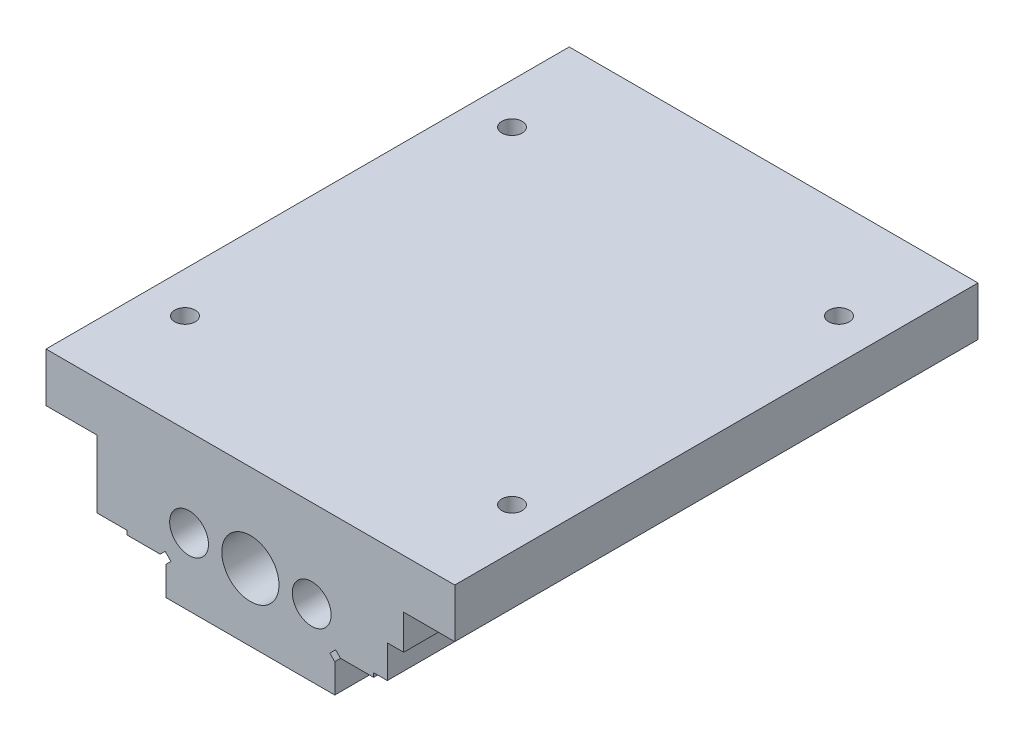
ISO-10303-21;
HEADER;
FILE_DESCRIPTION(('STEP AP214'),'2;1');
FILE_NAME('part.step','',(''),(''),'','','');
FILE_SCHEMA(('AUTOMOTIVE_DESIGN { 1 0 10303 214 1 1 1 1 }'));
ENDSEC;
DATA;
#1=APPLICATION_CONTEXT('core data for automotive mechanical design processes');
#2=APPLICATION_PROTOCOL_DEFINITION('international standard','automotive_design',2000,#1);
#3=PRODUCT_CONTEXT('',#1,'mechanical');
#4=PRODUCT('Part','Part','',(#3));
#5=PRODUCT_RELATED_PRODUCT_CATEGORY('part','',(#4));
#6=PRODUCT_DEFINITION_FORMATION('','',#4);
#7=PRODUCT_DEFINITION_CONTEXT('part definition',#1,'design');
#8=PRODUCT_DEFINITION('design','',#6,#7);
#9=PRODUCT_DEFINITION_SHAPE('','',#8);
#10=(LENGTH_UNIT() NAMED_UNIT(*) SI_UNIT(.MILLI.,.METRE.));
#11=(NAMED_UNIT(*) PLANE_ANGLE_UNIT() SI_UNIT($,.RADIAN.));
#12=(NAMED_UNIT(*) SI_UNIT($,.STERADIAN.) SOLID_ANGLE_UNIT());
#13=UNCERTAINTY_MEASURE_WITH_UNIT(LENGTH_MEASURE(1.E-05),#10,'distance_accuracy_value','');
#14=(GEOMETRIC_REPRESENTATION_CONTEXT(3) GLOBAL_UNCERTAINTY_ASSIGNED_CONTEXT((#13)) GLOBAL_UNIT_ASSIGNED_CONTEXT((#10,
#11,#12)) REPRESENTATION_CONTEXT('',''));
#15=CARTESIAN_POINT('',(0.,0.,0.));
#16=DIRECTION('',(0.,0.,1.));
#17=DIRECTION('',(1.,0.,0.));
#18=AXIS2_PLACEMENT_3D('',#15,#16,#17);
#19=CARTESIAN_POINT('',(30.15,-8.,128.));
#20=DIRECTION('',(0.,1.,0.));
#21=DIRECTION('',(-1.,0.,0.));
#22=AXIS2_PLACEMENT_3D('',#19,#20,#21);
#23=PLANE('',#22);
#24=DIRECTION('',(1.,0.,0.));
#25=VECTOR('',#24,1.);
#26=CARTESIAN_POINT('',(30.15,-8.,0.));
#27=LINE('',#26,#25);
#28=CARTESIAN_POINT('',(22.0542135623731,-7.99999999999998,0.));
#29=VERTEX_POINT('',#28);
#30=CARTESIAN_POINT('',(30.15,-8.,0.));
#31=VERTEX_POINT('',#30);
#32=EDGE_CURVE('E581',#29,#31,#27,.T.);
#33=ORIENTED_EDGE('',*,*,#32,.T.);
#34=DIRECTION('',(0.,0.,-1.));
#35=VECTOR('',#34,1.);
#36=CARTESIAN_POINT('',(30.15,-8.,128.));
#37=LINE('',#36,#35);
#38=CARTESIAN_POINT('',(30.15,-8.,128.));
#39=VERTEX_POINT('',#38);
#40=EDGE_CURVE('E641',#39,#31,#37,.T.);
#41=ORIENTED_EDGE('',*,*,#40,.F.);
#42=DIRECTION('',(1.,0.,0.));
#43=VECTOR('',#42,1.);
#44=CARTESIAN_POINT('',(30.15,-8.,128.));
#45=LINE('',#44,#43);
#46=CARTESIAN_POINT('',(22.0542135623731,-7.99999999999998,128.));
#47=VERTEX_POINT('',#46);
#48=EDGE_CURVE('E622',#47,#39,#45,.T.);
#49=ORIENTED_EDGE('',*,*,#48,.F.);
#50=DIRECTION('',(0.,0.,-1.));
#51=VECTOR('',#50,1.);
#52=CARTESIAN_POINT('',(22.0542135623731,-7.99999999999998,128.));
#53=LINE('',#52,#51);
#54=EDGE_CURVE('E644',#47,#29,#53,.T.);
#55=ORIENTED_EDGE('',*,*,#54,.T.);
#56=EDGE_LOOP('',(#33,#41,#49,#55));
#57=FACE_BOUND('',#56,.T.);
#58=CARTESIAN_POINT('',(25.49,-8.,14.));
#59=DIRECTION('',(0.,1.,0.));
#60=DIRECTION('',(0.,0.,-1.));
#61=AXIS2_PLACEMENT_3D('',#58,#59,#60);
#62=CIRCLE('',#61,1.25);
#63=CARTESIAN_POINT('',(25.49,-8.,12.75));
#64=VERTEX_POINT('',#63);
#65=EDGE_CURVE('E350',#64,#64,#62,.T.);
#66=ORIENTED_EDGE('',*,*,#65,.T.);
#67=EDGE_LOOP('',(#66));
#68=FACE_BOUND('',#67,.T.);
#69=CARTESIAN_POINT('',(25.49,-8.,39.));
#70=DIRECTION('',(0.,1.,0.));
#71=DIRECTION('',(0.,0.,-1.));
#72=AXIS2_PLACEMENT_3D('',#69,#70,#71);
#73=CIRCLE('',#72,1.25);
#74=CARTESIAN_POINT('',(25.49,-8.,37.75));
#75=VERTEX_POINT('',#74);
#76=EDGE_CURVE('E344',#75,#75,#73,.T.);
#77=ORIENTED_EDGE('',*,*,#76,.T.);
#78=EDGE_LOOP('',(#77));
#79=FACE_BOUND('',#78,.T.);
#80=CARTESIAN_POINT('',(25.49,-8.,64.));
#81=DIRECTION('',(0.,1.,0.));
#82=DIRECTION('',(0.,0.,-1.));
#83=AXIS2_PLACEMENT_3D('',#80,#81,#82);
#84=CIRCLE('',#83,1.25);
#85=CARTESIAN_POINT('',(25.49,-8.,62.75));
#86=VERTEX_POINT('',#85);
#87=EDGE_CURVE('E338',#86,#86,#84,.T.);
#88=ORIENTED_EDGE('',*,*,#87,.T.);
#89=EDGE_LOOP('',(#88));
#90=FACE_BOUND('',#89,.T.);
#91=CARTESIAN_POINT('',(25.49,-8.,89.));
#92=DIRECTION('',(0.,1.,0.));
#93=DIRECTION('',(0.,0.,-1.));
#94=AXIS2_PLACEMENT_3D('',#91,#92,#93);
#95=CIRCLE('',#94,1.25);
#96=CARTESIAN_POINT('',(25.49,-8.,87.75));
#97=VERTEX_POINT('',#96);
#98=EDGE_CURVE('E332',#97,#97,#95,.T.);
#99=ORIENTED_EDGE('',*,*,#98,.T.);
#100=EDGE_LOOP('',(#99));
#101=FACE_BOUND('',#100,.T.);
#102=CARTESIAN_POINT('',(25.49,-8.,114.));
#103=DIRECTION('',(0.,1.,0.));
#104=DIRECTION('',(0.,0.,-1.));
#105=AXIS2_PLACEMENT_3D('',#102,#103,#104);
#106=CIRCLE('',#105,1.25);
#107=CARTESIAN_POINT('',(25.49,-8.,112.75));
#108=VERTEX_POINT('',#107);
#109=EDGE_CURVE('E319',#108,#108,#106,.T.);
#110=ORIENTED_EDGE('',*,*,#109,.T.);
#111=EDGE_LOOP('',(#110));
#112=FACE_BOUND('',#111,.T.);
#113=CARTESIAN_POINT('',(25.49,-7.99999999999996,76.5));
#114=DIRECTION('',(0.,1.,0.));
#115=DIRECTION('',(-1.,0.,0.));
#116=AXIS2_PLACEMENT_3D('',#113,#114,#115);
#117=CIRCLE('',#116,1.20000000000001);
#118=CARTESIAN_POINT('',(24.29,-7.99999999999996,76.5));
#119=VERTEX_POINT('',#118);
#120=EDGE_CURVE('E326',#119,#119,#117,.T.);
#121=ORIENTED_EDGE('',*,*,#120,.T.);
#122=EDGE_LOOP('',(#121));
#123=FACE_BOUND('',#122,.T.);
#124=ADVANCED_FACE('F29',(#57,#68,#79,#90,#101,#112,#123),#23,.F.);
#125=CARTESIAN_POINT('',(37.5,9.5,128.));
#126=DIRECTION('',(-1.,0.,0.));
#127=DIRECTION('',(0.,0.,1.));
#128=AXIS2_PLACEMENT_3D('',#125,#126,#127);
#129=PLANE('',#128);
#130=DIRECTION('',(0.,0.,-1.));
#131=VECTOR('',#130,1.);
#132=CARTESIAN_POINT('',(37.5,1.,128.));
#133=LINE('',#132,#131);
#134=CARTESIAN_POINT('',(37.5,1.,128.));
#135=VERTEX_POINT('',#134);
#136=CARTESIAN_POINT('',(37.5,1.,108.404543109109));
#137=VERTEX_POINT('',#136);
#138=EDGE_CURVE('E546',#135,#137,#133,.T.);
#139=ORIENTED_EDGE('',*,*,#138,.T.);
#140=DIRECTION('',(0.,1.,0.));
#141=VECTOR('',#140,1.);
#142=CARTESIAN_POINT('',(37.5,-16.5,108.404543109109));
#143=LINE('',#142,#141);
#144=CARTESIAN_POINT('',(37.5,9.50000000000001,108.404543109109));
#145=VERTEX_POINT('',#144);
#146=EDGE_CURVE('E43',#137,#145,#143,.T.);
#147=ORIENTED_EDGE('',*,*,#146,.T.);
#148=DIRECTION('',(0.,0.,-1.));
#149=VECTOR('',#148,1.);
#150=CARTESIAN_POINT('',(37.5,9.5,128.));
#151=LINE('',#150,#149);
#152=CARTESIAN_POINT('',(37.5,9.5,128.));
#153=VERTEX_POINT('',#152);
#154=EDGE_CURVE('E634',#153,#145,#151,.T.);
#155=ORIENTED_EDGE('',*,*,#154,.F.);
#156=DIRECTION('',(0.,1.,0.));
#157=VECTOR('',#156,1.);
#158=CARTESIAN_POINT('',(37.5,9.5,128.));
#159=LINE('',#158,#157);
#160=EDGE_CURVE('E629',#135,#153,#159,.T.);
#161=ORIENTED_EDGE('',*,*,#160,.F.);
#162=EDGE_LOOP('',(#139,#147,#155,#161));
#163=FACE_BOUND('',#162,.T.);
#164=ADVANCED_FACE('F741',(#163),#129,.F.);
#165=CARTESIAN_POINT('',(37.5,9.50000000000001,99.595456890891));
#166=VERTEX_POINT('',#165);
#167=CARTESIAN_POINT('',(37.5,9.50000000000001,28.404543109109));
#168=VERTEX_POINT('',#167);
#169=EDGE_CURVE('E638',#166,#168,#151,.T.);
#170=ORIENTED_EDGE('',*,*,#169,.F.);
#171=DIRECTION('',(0.,1.,0.));
#172=VECTOR('',#171,1.);
#173=CARTESIAN_POINT('',(37.5,-16.5,99.595456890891));
#174=LINE('',#173,#172);
#175=CARTESIAN_POINT('',(37.5,1.,99.595456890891));
#176=VERTEX_POINT('',#175);
#177=EDGE_CURVE('E361',#166,#176,#174,.F.);
#178=ORIENTED_EDGE('',*,*,#177,.T.);
#179=CARTESIAN_POINT('',(37.5,1.,28.404543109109));
#180=VERTEX_POINT('',#179);
#181=EDGE_CURVE('E51',#176,#180,#133,.T.);
#182=ORIENTED_EDGE('',*,*,#181,.T.);
#183=DIRECTION('',(0.,1.,0.));
#184=VECTOR('',#183,1.);
#185=CARTESIAN_POINT('',(37.5,-16.5,28.404543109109));
#186=LINE('',#185,#184);
#187=EDGE_CURVE('E370',#180,#168,#186,.T.);
#188=ORIENTED_EDGE('',*,*,#187,.T.);
#189=EDGE_LOOP('',(#170,#178,#182,#188));
#190=FACE_BOUND('',#189,.T.);
#191=ADVANCED_FACE('F739',(#190),#129,.F.);
#192=CARTESIAN_POINT('',(45.,9.5,128.));
#193=DIRECTION('',(0.,1.,0.));
#194=DIRECTION('',(-1.,0.,0.));
#195=AXIS2_PLACEMENT_3D('',#192,#193,#194);
#196=PLANE('',#195);
#197=CARTESIAN_POINT('',(46.7,9.50000000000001,104.));
#198=DIRECTION('',(0.,1.,0.));
#199=DIRECTION('',(0.,0.,-1.));
#200=AXIS2_PLACEMENT_3D('',#197,#198,#199);
#201=CIRCLE('',#200,10.2);
#202=EDGE_CURVE('E359',#166,#145,#201,.T.);
#203=ORIENTED_EDGE('',*,*,#202,.F.);
#204=ORIENTED_EDGE('',*,*,#169,.T.);
#205=CARTESIAN_POINT('',(46.7,9.50000000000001,24.));
#206=DIRECTION('',(0.,1.,0.));
#207=DIRECTION('',(0.,0.,-1.));
#208=AXIS2_PLACEMENT_3D('',#205,#206,#207);
#209=CIRCLE('',#208,10.2);
#210=CARTESIAN_POINT('',(37.5,9.50000000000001,19.595456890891));
#211=VERTEX_POINT('',#210);
#212=EDGE_CURVE('E364',#211,#168,#209,.T.);
#213=ORIENTED_EDGE('',*,*,#212,.F.);
#214=CARTESIAN_POINT('',(37.5,9.5,0.));
#215=VERTEX_POINT('',#214);
#216=EDGE_CURVE('E633',#211,#215,#151,.T.);
#217=ORIENTED_EDGE('',*,*,#216,.T.);
#218=DIRECTION('',(1.,0.,0.));
#219=VECTOR('',#218,1.);
#220=CARTESIAN_POINT('',(45.,9.5,0.));
#221=LINE('',#220,#219);
#222=CARTESIAN_POINT('',(50.,9.5,0.));
#223=VERTEX_POINT('',#222);
#224=EDGE_CURVE('E591',#215,#223,#221,.T.);
#225=ORIENTED_EDGE('',*,*,#224,.T.);
#226=DIRECTION('',(0.,0.,-1.));
#227=VECTOR('',#226,1.);
#228=CARTESIAN_POINT('',(50.,9.5,128.));
#229=LINE('',#228,#227);
#230=CARTESIAN_POINT('',(50.,9.5,128.));
#231=VERTEX_POINT('',#230);
#232=EDGE_CURVE('E527',#231,#223,#229,.T.);
#233=ORIENTED_EDGE('',*,*,#232,.F.);
#234=DIRECTION('',(1.,0.,0.));
#235=VECTOR('',#234,1.);
#236=CARTESIAN_POINT('',(45.,9.5,128.));
#237=LINE('',#236,#235);
#238=EDGE_CURVE('E631',#153,#231,#237,.T.);
#239=ORIENTED_EDGE('',*,*,#238,.F.);
#240=ORIENTED_EDGE('',*,*,#154,.T.);
#241=EDGE_LOOP('',(#203,#204,#213,#217,#225,#233,#239,#240));
#242=FACE_BOUND('',#241,.T.);
#243=CARTESIAN_POINT('',(40.,9.5,104.));
#244=DIRECTION('',(0.,1.,0.));
#245=DIRECTION('',(-1.,0.,0.));
#246=AXIS2_PLACEMENT_3D('',#243,#244,#245);
#247=CIRCLE('',#246,2.5);
#248=CARTESIAN_POINT('',(37.5,9.5,104.));
#249=VERTEX_POINT('',#248);
#250=EDGE_CURVE('E375',#249,#249,#247,.F.);
#251=ORIENTED_EDGE('',*,*,#250,.F.);
#252=EDGE_LOOP('',(#251));
#253=FACE_BOUND('',#252,.T.);
#254=CARTESIAN_POINT('',(40.,9.5,24.));
#255=DIRECTION('',(0.,1.,0.));
#256=DIRECTION('',(-1.,0.,0.));
#257=AXIS2_PLACEMENT_3D('',#254,#255,#256);
#258=CIRCLE('',#257,2.5);
#259=CARTESIAN_POINT('',(37.5,9.5,24.));
#260=VERTEX_POINT('',#259);
#261=EDGE_CURVE('E381',#260,#260,#258,.F.);
#262=ORIENTED_EDGE('',*,*,#261,.F.);
#263=EDGE_LOOP('',(#262));
#264=FACE_BOUND('',#263,.T.);
#265=ADVANCED_FACE('F734',(#242,#253,#264),#196,.F.);
#266=CARTESIAN_POINT('',(-50.,21.5,128.));
#267=DIRECTION('',(0.,-1.,0.));
#268=DIRECTION('',(0.,0.,-1.));
#269=AXIS2_PLACEMENT_3D('',#266,#267,#268);
#270=PLANE('',#269);
#271=CARTESIAN_POINT('',(40.,21.5,24.));
#272=DIRECTION('',(0.,-1.,0.));
#273=DIRECTION('',(0.,0.,1.));
#274=AXIS2_PLACEMENT_3D('',#271,#272,#273);
#275=CIRCLE('',#274,2.5);
#276=CARTESIAN_POINT('',(40.,21.5,26.5));
#277=VERTEX_POINT('',#276);
#278=EDGE_CURVE('E378',#277,#277,#275,.T.);
#279=ORIENTED_EDGE('',*,*,#278,.T.);
#280=EDGE_LOOP('',(#279));
#281=FACE_BOUND('',#280,.T.);
#282=CARTESIAN_POINT('',(-40.,21.5,104.));
#283=DIRECTION('',(0.,1.,0.));
#284=DIRECTION('',(0.,0.,1.));
#285=AXIS2_PLACEMENT_3D('',#282,#283,#284);
#286=CIRCLE('',#285,2.5);
#287=CARTESIAN_POINT('',(-40.,21.5,106.5));
#288=VERTEX_POINT('',#287);
#289=EDGE_CURVE('E435',#288,#288,#286,.T.);
#290=ORIENTED_EDGE('',*,*,#289,.F.);
#291=EDGE_LOOP('',(#290));
#292=FACE_BOUND('',#291,.T.);
#293=CARTESIAN_POINT('',(-40.,21.5,24.));
#294=DIRECTION('',(0.,1.,0.));
#295=DIRECTION('',(0.,0.,1.));
#296=AXIS2_PLACEMENT_3D('',#293,#294,#295);
#297=CIRCLE('',#296,2.5);
#298=CARTESIAN_POINT('',(-40.,21.5,26.5));
#299=VERTEX_POINT('',#298);
#300=EDGE_CURVE('E449',#299,#299,#297,.T.);
#301=ORIENTED_EDGE('',*,*,#300,.F.);
#302=EDGE_LOOP('',(#301));
#303=FACE_BOUND('',#302,.T.);
#304=DIRECTION('',(-1.,0.,0.));
#305=VECTOR('',#304,1.);
#306=CARTESIAN_POINT('',(-50.,21.5,0.));
#307=LINE('',#306,#305);
#308=CARTESIAN_POINT('',(50.,21.5,0.));
#309=VERTEX_POINT('',#308);
#310=CARTESIAN_POINT('',(-50.,21.5,0.));
#311=VERTEX_POINT('',#310);
#312=EDGE_CURVE('E512',#309,#311,#307,.T.);
#313=ORIENTED_EDGE('',*,*,#312,.T.);
#314=DIRECTION('',(0.,0.,-1.));
#315=VECTOR('',#314,1.);
#316=CARTESIAN_POINT('',(-50.,21.5,128.));
#317=LINE('',#316,#315);
#318=CARTESIAN_POINT('',(-50.,21.5,128.));
#319=VERTEX_POINT('',#318);
#320=EDGE_CURVE('E521',#319,#311,#317,.T.);
#321=ORIENTED_EDGE('',*,*,#320,.F.);
#322=DIRECTION('',(-1.,0.,0.));
#323=VECTOR('',#322,1.);
#324=CARTESIAN_POINT('',(-50.,21.5,128.));
#325=LINE('',#324,#323);
#326=CARTESIAN_POINT('',(50.,21.5,128.));
#327=VERTEX_POINT('',#326);
#328=EDGE_CURVE('E519',#327,#319,#325,.T.);
#329=ORIENTED_EDGE('',*,*,#328,.F.);
#330=DIRECTION('',(0.,0.,-1.));
#331=VECTOR('',#330,1.);
#332=CARTESIAN_POINT('',(50.,21.5,128.));
#333=LINE('',#332,#331);
#334=EDGE_CURVE('E524',#327,#309,#333,.T.);
#335=ORIENTED_EDGE('',*,*,#334,.T.);
#336=EDGE_LOOP('',(#313,#321,#329,#335));
#337=FACE_BOUND('',#336,.T.);
#338=CARTESIAN_POINT('',(40.,21.5,104.));
#339=DIRECTION('',(0.,-1.,0.));
#340=DIRECTION('',(0.,0.,1.));
#341=AXIS2_PLACEMENT_3D('',#338,#339,#340);
#342=CIRCLE('',#341,2.5);
#343=CARTESIAN_POINT('',(40.,21.5,106.5));
#344=VERTEX_POINT('',#343);
#345=EDGE_CURVE('E372',#344,#344,#342,.T.);
#346=ORIENTED_EDGE('',*,*,#345,.T.);
#347=EDGE_LOOP('',(#346));
#348=FACE_BOUND('',#347,.T.);
#349=ADVANCED_FACE('F747',(#281,#292,#303,#337,#348),#270,.F.);
#350=CARTESIAN_POINT('',(-37.5,9.5,128.));
#351=DIRECTION('',(1.,0.,0.));
#352=DIRECTION('',(0.,0.,-1.));
#353=AXIS2_PLACEMENT_3D('',#350,#351,#352);
#354=PLANE('',#353);
#355=DIRECTION('',(0.,1.,0.));
#356=VECTOR('',#355,1.);
#357=CARTESIAN_POINT('',(-37.5,-16.5,99.595456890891));
#358=LINE('',#357,#356);
#359=CARTESIAN_POINT('',(-37.5,9.50000000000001,99.595456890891));
#360=VERTEX_POINT('',#359);
#361=CARTESIAN_POINT('',(-37.5,-7.,99.595456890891));
#362=VERTEX_POINT('',#361);
#363=EDGE_CURVE('E433',#360,#362,#358,.F.);
#364=ORIENTED_EDGE('',*,*,#363,.F.);
#365=DIRECTION('',(0.,0.,-1.));
#366=VECTOR('',#365,1.);
#367=CARTESIAN_POINT('',(-37.5,9.5,128.));
#368=LINE('',#367,#366);
#369=CARTESIAN_POINT('',(-37.5,9.50000000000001,28.404543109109));
#370=VERTEX_POINT('',#369);
#371=EDGE_CURVE('E690',#360,#370,#368,.T.);
#372=ORIENTED_EDGE('',*,*,#371,.T.);
#373=DIRECTION('',(0.,1.,0.));
#374=VECTOR('',#373,1.);
#375=CARTESIAN_POINT('',(-37.5,-16.5,28.404543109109));
#376=LINE('',#375,#374);
#377=CARTESIAN_POINT('',(-37.5,-7.,28.404543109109));
#378=VERTEX_POINT('',#377);
#379=EDGE_CURVE('E444',#378,#370,#376,.T.);
#380=ORIENTED_EDGE('',*,*,#379,.F.);
#381=DIRECTION('',(0.,0.,-1.));
#382=VECTOR('',#381,1.);
#383=CARTESIAN_POINT('',(-37.5,-7.,128.));
#384=LINE('',#383,#382);
#385=EDGE_CURVE('E685',#362,#378,#384,.T.);
#386=ORIENTED_EDGE('',*,*,#385,.F.);
#387=EDGE_LOOP('',(#364,#372,#380,#386));
#388=FACE_BOUND('',#387,.T.);
#389=ADVANCED_FACE('F815',(#388),#354,.F.);
#390=DIRECTION('',(0.,1.,0.));
#391=VECTOR('',#390,1.);
#392=CARTESIAN_POINT('',(-37.5,-16.5,108.404543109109));
#393=LINE('',#392,#391);
#394=CARTESIAN_POINT('',(-37.5,-7.,108.404543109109));
#395=VERTEX_POINT('',#394);
#396=CARTESIAN_POINT('',(-37.5,9.50000000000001,108.404543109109));
#397=VERTEX_POINT('',#396);
#398=EDGE_CURVE('E431',#395,#397,#393,.T.);
#399=ORIENTED_EDGE('',*,*,#398,.F.);
#400=CARTESIAN_POINT('',(-37.5,-7.,128.));
#401=VERTEX_POINT('',#400);
#402=EDGE_CURVE('E681',#401,#395,#384,.T.);
#403=ORIENTED_EDGE('',*,*,#402,.F.);
#404=DIRECTION('',(0.,-1.,0.));
#405=VECTOR('',#404,1.);
#406=CARTESIAN_POINT('',(-37.5,9.5,128.));
#407=LINE('',#406,#405);
#408=CARTESIAN_POINT('',(-37.5,9.5,128.));
#409=VERTEX_POINT('',#408);
#410=EDGE_CURVE('E596',#409,#401,#407,.T.);
#411=ORIENTED_EDGE('',*,*,#410,.F.);
#412=EDGE_CURVE('E686',#409,#397,#368,.T.);
#413=ORIENTED_EDGE('',*,*,#412,.T.);
#414=EDGE_LOOP('',(#399,#403,#411,#413));
#415=FACE_BOUND('',#414,.T.);
#416=ADVANCED_FACE('F811',(#415),#354,.F.);
#417=CARTESIAN_POINT('',(-37.5,-7.,128.));
#418=DIRECTION('',(0.,1.,0.));
#419=DIRECTION('',(0.,0.,1.));
#420=AXIS2_PLACEMENT_3D('',#417,#418,#419);
#421=PLANE('',#420);
#422=CARTESIAN_POINT('',(-46.7,-7.,104.));
#423=DIRECTION('',(0.,1.,0.));
#424=DIRECTION('',(0.,0.,1.));
#425=AXIS2_PLACEMENT_3D('',#422,#423,#424);
#426=CIRCLE('',#425,10.2);
#427=EDGE_CURVE('E429',#362,#395,#426,.F.);
#428=ORIENTED_EDGE('',*,*,#427,.F.);
#429=ORIENTED_EDGE('',*,*,#385,.T.);
#430=CARTESIAN_POINT('',(-46.7,-7.,24.));
#431=DIRECTION('',(0.,1.,0.));
#432=DIRECTION('',(0.,0.,1.));
#433=AXIS2_PLACEMENT_3D('',#430,#431,#432);
#434=CIRCLE('',#433,10.2);
#435=CARTESIAN_POINT('',(-37.5,-7.,19.595456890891));
#436=VERTEX_POINT('',#435);
#437=EDGE_CURVE('E709',#436,#378,#434,.F.);
#438=ORIENTED_EDGE('',*,*,#437,.F.);
#439=CARTESIAN_POINT('',(-37.5,-7.,0.));
#440=VERTEX_POINT('',#439);
#441=EDGE_CURVE('E680',#436,#440,#384,.T.);
#442=ORIENTED_EDGE('',*,*,#441,.T.);
#443=DIRECTION('',(1.,0.,0.));
#444=VECTOR('',#443,1.);
#445=CARTESIAN_POINT('',(-37.5,-7.,0.));
#446=LINE('',#445,#444);
#447=CARTESIAN_POINT('',(-30.15,-7.,0.));
#448=VERTEX_POINT('',#447);
#449=EDGE_CURVE('E555',#440,#448,#446,.T.);
#450=ORIENTED_EDGE('',*,*,#449,.T.);
#451=DIRECTION('',(0.,0.,-1.));
#452=VECTOR('',#451,1.);
#453=CARTESIAN_POINT('',(-30.15,-7.,128.));
#454=LINE('',#453,#452);
#455=CARTESIAN_POINT('',(-30.15,-7.,128.));
#456=VERTEX_POINT('',#455);
#457=EDGE_CURVE('E677',#456,#448,#454,.T.);
#458=ORIENTED_EDGE('',*,*,#457,.F.);
#459=DIRECTION('',(1.,0.,0.));
#460=VECTOR('',#459,1.);
#461=CARTESIAN_POINT('',(-37.5,-7.,128.));
#462=LINE('',#461,#460);
#463=EDGE_CURVE('E598',#401,#456,#462,.T.);
#464=ORIENTED_EDGE('',*,*,#463,.F.);
#465=ORIENTED_EDGE('',*,*,#402,.T.);
#466=EDGE_LOOP('',(#428,#429,#438,#442,#450,#458,#464,#465));
#467=FACE_BOUND('',#466,.T.);
#468=ADVANCED_FACE('F808',(#467),#421,.F.);
#469=DIRECTION('',(0.,1.,0.));
#470=VECTOR('',#469,1.);
#471=CARTESIAN_POINT('',(-37.5,-16.5,19.595456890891));
#472=LINE('',#471,#470);
#473=CARTESIAN_POINT('',(-37.5,9.50000000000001,19.595456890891));
#474=VERTEX_POINT('',#473);
#475=EDGE_CURVE('E447',#474,#436,#472,.F.);
#476=ORIENTED_EDGE('',*,*,#475,.F.);
#477=CARTESIAN_POINT('',(-37.5,9.5,0.));
#478=VERTEX_POINT('',#477);
#479=EDGE_CURVE('E684',#474,#478,#368,.T.);
#480=ORIENTED_EDGE('',*,*,#479,.T.);
#481=DIRECTION('',(0.,-1.,0.));
#482=VECTOR('',#481,1.);
#483=CARTESIAN_POINT('',(-37.5,9.5,0.));
#484=LINE('',#483,#482);
#485=EDGE_CURVE('E552',#478,#440,#484,.T.);
#486=ORIENTED_EDGE('',*,*,#485,.T.);
#487=ORIENTED_EDGE('',*,*,#441,.F.);
#488=EDGE_LOOP('',(#476,#480,#486,#487));
#489=FACE_BOUND('',#488,.T.);
#490=ADVANCED_FACE('F810',(#489),#354,.F.);
#491=CARTESIAN_POINT('',(37.5,-7.,128.));
#492=DIRECTION('',(0.,1.,0.));
#493=DIRECTION('',(0.,0.,1.));
#494=AXIS2_PLACEMENT_3D('',#491,#492,#493);
#495=PLANE('',#494);
#496=DIRECTION('',(0.,0.,-1.));
#497=VECTOR('',#496,1.);
#498=CARTESIAN_POINT('',(33.5,-7.,128.));
#499=LINE('',#498,#497);
#500=CARTESIAN_POINT('',(33.5,-7.,128.));
#501=VERTEX_POINT('',#500);
#502=CARTESIAN_POINT('',(33.5,-7.,0.));
#503=VERTEX_POINT('',#502);
#504=EDGE_CURVE('E541',#501,#503,#499,.T.);
#505=ORIENTED_EDGE('',*,*,#504,.F.);
#506=DIRECTION('',(1.,0.,0.));
#507=VECTOR('',#506,1.);
#508=CARTESIAN_POINT('',(37.5,-7.,128.));
#509=LINE('',#508,#507);
#510=CARTESIAN_POINT('',(30.15,-7.,128.));
#511=VERTEX_POINT('',#510);
#512=EDGE_CURVE('E626',#511,#501,#509,.T.);
#513=ORIENTED_EDGE('',*,*,#512,.F.);
#514=DIRECTION('',(0.,0.,-1.));
#515=VECTOR('',#514,1.);
#516=CARTESIAN_POINT('',(30.15,-7.,128.));
#517=LINE('',#516,#515);
#518=CARTESIAN_POINT('',(30.15,-7.,0.));
#519=VERTEX_POINT('',#518);
#520=EDGE_CURVE('E637',#511,#519,#517,.T.);
#521=ORIENTED_EDGE('',*,*,#520,.T.);
#522=DIRECTION('',(1.,0.,0.));
#523=VECTOR('',#522,1.);
#524=CARTESIAN_POINT('',(37.5,-7.,0.));
#525=LINE('',#524,#523);
#526=EDGE_CURVE('E585',#519,#503,#525,.T.);
#527=ORIENTED_EDGE('',*,*,#526,.T.);
#528=EDGE_LOOP('',(#505,#513,#521,#527));
#529=FACE_BOUND('',#528,.T.);
#530=ADVANCED_FACE('F753',(#529),#495,.F.);
#531=ORIENTED_EDGE('',*,*,#216,.F.);
#532=DIRECTION('',(0.,1.,0.));
#533=VECTOR('',#532,1.);
#534=CARTESIAN_POINT('',(37.5,-16.5,19.595456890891));
#535=LINE('',#534,#533);
#536=CARTESIAN_POINT('',(37.5,1.,19.595456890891));
#537=VERTEX_POINT('',#536);
#538=EDGE_CURVE('E367',#211,#537,#535,.F.);
#539=ORIENTED_EDGE('',*,*,#538,.T.);
#540=CARTESIAN_POINT('',(37.5,1.,0.));
#541=VERTEX_POINT('',#540);
#542=EDGE_CURVE('E545',#537,#541,#133,.T.);
#543=ORIENTED_EDGE('',*,*,#542,.T.);
#544=DIRECTION('',(0.,1.,0.));
#545=VECTOR('',#544,1.);
#546=CARTESIAN_POINT('',(37.5,9.5,0.));
#547=LINE('',#546,#545);
#548=EDGE_CURVE('E588',#541,#215,#547,.T.);
#549=ORIENTED_EDGE('',*,*,#548,.T.);
#550=EDGE_LOOP('',(#531,#539,#543,#549));
#551=FACE_BOUND('',#550,.T.);
#552=ADVANCED_FACE('F719',(#551),#129,.F.);
#553=CARTESIAN_POINT('',(-28.95,20.,128.));
#554=DIRECTION('',(0.,0.,-1.));
#555=DIRECTION('',(-1.,0.,0.));
#556=AXIS2_PLACEMENT_3D('',#553,#554,#555);
#557=PLANE('',#556);
#558=CARTESIAN_POINT('',(15.,0.,128.));
#559=DIRECTION('',(0.,0.,-1.));
#560=DIRECTION('',(-1.,0.,0.));
#561=AXIS2_PLACEMENT_3D('',#558,#559,#560);
#562=CIRCLE('',#561,4.75);
#563=CARTESIAN_POINT('',(10.25,0.,128.));
#564=VERTEX_POINT('',#563);
#565=EDGE_CURVE('E356',#564,#564,#562,.T.);
#566=ORIENTED_EDGE('',*,*,#565,.T.);
#567=EDGE_LOOP('',(#566));
#568=FACE_BOUND('',#567,.T.);
#569=CARTESIAN_POINT('',(-15.,0.,128.));
#570=DIRECTION('',(0.,0.,1.));
#571=DIRECTION('',(1.,0.,0.));
#572=AXIS2_PLACEMENT_3D('',#569,#570,#571);
#573=CIRCLE('',#572,4.75);
#574=CARTESIAN_POINT('',(-10.25,0.,128.));
#575=VERTEX_POINT('',#574);
#576=EDGE_CURVE('E423',#575,#575,#573,.T.);
#577=ORIENTED_EDGE('',*,*,#576,.F.);
#578=EDGE_LOOP('',(#577));
#579=FACE_BOUND('',#578,.T.);
#580=CARTESIAN_POINT('',(0.,0.,128.));
#581=DIRECTION('',(0.,0.,-1.));
#582=DIRECTION('',(-1.,0.,0.));
#583=AXIS2_PLACEMENT_3D('',#580,#581,#582);
#584=CIRCLE('',#583,6.99999999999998);
#585=CARTESIAN_POINT('',(-6.99999999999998,0.,128.));
#586=VERTEX_POINT('',#585);
#587=EDGE_CURVE('E479',#586,#586,#584,.T.);
#588=ORIENTED_EDGE('',*,*,#587,.T.);
#589=EDGE_LOOP('',(#588));
#590=FACE_BOUND('',#589,.T.);
#591=DIRECTION('',(0.,-1.,0.));
#592=VECTOR('',#591,1.);
#593=CARTESIAN_POINT('',(-50.,9.5,128.));
#594=LINE('',#593,#592);
#595=CARTESIAN_POINT('',(-50.,9.5,128.));
#596=VERTEX_POINT('',#595);
#597=EDGE_CURVE('E514',#319,#596,#594,.T.);
#598=ORIENTED_EDGE('',*,*,#597,.T.);
#599=DIRECTION('',(1.,0.,0.));
#600=VECTOR('',#599,1.);
#601=CARTESIAN_POINT('',(-45.,9.5,128.));
#602=LINE('',#601,#600);
#603=EDGE_CURVE('E594',#596,#409,#602,.T.);
#604=ORIENTED_EDGE('',*,*,#603,.T.);
#605=ORIENTED_EDGE('',*,*,#410,.T.);
#606=ORIENTED_EDGE('',*,*,#463,.T.);
#607=DIRECTION('',(0.,-1.,0.));
#608=VECTOR('',#607,1.);
#609=CARTESIAN_POINT('',(-30.15,-7.,128.));
#610=LINE('',#609,#608);
#611=CARTESIAN_POINT('',(-30.15,-8.,128.));
#612=VERTEX_POINT('',#611);
#613=EDGE_CURVE('E600',#456,#612,#610,.T.);
#614=ORIENTED_EDGE('',*,*,#613,.T.);
#615=DIRECTION('',(1.,0.,0.));
#616=VECTOR('',#615,1.);
#617=CARTESIAN_POINT('',(-30.15,-8.,128.));
#618=LINE('',#617,#616);
#619=CARTESIAN_POINT('',(-22.0542135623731,-7.99999999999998,128.));
#620=VERTEX_POINT('',#619);
#621=EDGE_CURVE('E602',#612,#620,#618,.T.);
#622=ORIENTED_EDGE('',*,*,#621,.T.);
#623=DIRECTION('',(0.707106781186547,0.707106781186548,0.));
#624=VECTOR('',#623,1.);
#625=CARTESIAN_POINT('',(-22.0542135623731,-7.99999999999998,128.));
#626=LINE('',#625,#624);
#627=CARTESIAN_POINT('',(-20.852132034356,-6.79791847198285,128.));
#628=VERTEX_POINT('',#627);
#629=EDGE_CURVE('E604',#620,#628,#626,.T.);
#630=ORIENTED_EDGE('',*,*,#629,.T.);
#631=DIRECTION('',(0.707106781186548,-0.707106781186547,0.));
#632=VECTOR('',#631,1.);
#633=CARTESIAN_POINT('',(-20.852132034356,-6.79791847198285,128.));
#634=LINE('',#633,#632);
#635=CARTESIAN_POINT('',(-19.4379184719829,-8.21213203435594,128.));
#636=VERTEX_POINT('',#635);
#637=EDGE_CURVE('E606',#628,#636,#634,.T.);
#638=ORIENTED_EDGE('',*,*,#637,.T.);
#639=DIRECTION('',(-0.707106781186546,-0.707106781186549,0.));
#640=VECTOR('',#639,1.);
#641=CARTESIAN_POINT('',(-19.4379184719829,-8.21213203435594,128.));
#642=LINE('',#641,#640);
#643=CARTESIAN_POINT('',(-20.64,-9.41421356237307,128.));
#644=VERTEX_POINT('',#643);
#645=EDGE_CURVE('E608',#636,#644,#642,.T.);
#646=ORIENTED_EDGE('',*,*,#645,.T.);
#647=DIRECTION('',(0.,-1.,0.));
#648=VECTOR('',#647,1.);
#649=CARTESIAN_POINT('',(-20.64,-9.41421356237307,128.));
#650=LINE('',#649,#648);
#651=CARTESIAN_POINT('',(-20.64,-16.5,128.));
#652=VERTEX_POINT('',#651);
#653=EDGE_CURVE('E610',#644,#652,#650,.T.);
#654=ORIENTED_EDGE('',*,*,#653,.T.);
#655=DIRECTION('',(1.,0.,0.));
#656=VECTOR('',#655,1.);
#657=CARTESIAN_POINT('',(-20.64,-16.5,128.));
#658=LINE('',#657,#656);
#659=CARTESIAN_POINT('',(20.64,-16.5,128.));
#660=VERTEX_POINT('',#659);
#661=EDGE_CURVE('E612',#652,#660,#658,.T.);
#662=ORIENTED_EDGE('',*,*,#661,.T.);
#663=DIRECTION('',(0.,1.,0.));
#664=VECTOR('',#663,1.);
#665=CARTESIAN_POINT('',(20.64,-9.41421356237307,128.));
#666=LINE('',#665,#664);
#667=CARTESIAN_POINT('',(20.64,-9.41421356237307,128.));
#668=VERTEX_POINT('',#667);
#669=EDGE_CURVE('E614',#660,#668,#666,.T.);
#670=ORIENTED_EDGE('',*,*,#669,.T.);
#671=DIRECTION('',(-0.707106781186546,0.707106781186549,0.));
#672=VECTOR('',#671,1.);
#673=CARTESIAN_POINT('',(19.4379184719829,-8.21213203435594,128.));
#674=LINE('',#673,#672);
#675=CARTESIAN_POINT('',(19.4379184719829,-8.21213203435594,128.));
#676=VERTEX_POINT('',#675);
#677=EDGE_CURVE('E616',#668,#676,#674,.T.);
#678=ORIENTED_EDGE('',*,*,#677,.T.);
#679=DIRECTION('',(0.707106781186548,0.707106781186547,0.));
#680=VECTOR('',#679,1.);
#681=CARTESIAN_POINT('',(20.852132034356,-6.79791847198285,128.));
#682=LINE('',#681,#680);
#683=CARTESIAN_POINT('',(20.852132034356,-6.79791847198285,128.));
#684=VERTEX_POINT('',#683);
#685=EDGE_CURVE('E618',#676,#684,#682,.T.);
#686=ORIENTED_EDGE('',*,*,#685,.T.);
#687=DIRECTION('',(0.707106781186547,-0.707106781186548,0.));
#688=VECTOR('',#687,1.);
#689=CARTESIAN_POINT('',(22.0542135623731,-7.99999999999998,128.));
#690=LINE('',#689,#688);
#691=EDGE_CURVE('E620',#684,#47,#690,.T.);
#692=ORIENTED_EDGE('',*,*,#691,.T.);
#693=ORIENTED_EDGE('',*,*,#48,.T.);
#694=DIRECTION('',(0.,1.,0.));
#695=VECTOR('',#694,1.);
#696=CARTESIAN_POINT('',(30.15,-7.,128.));
#697=LINE('',#696,#695);
#698=EDGE_CURVE('E624',#39,#511,#697,.T.);
#699=ORIENTED_EDGE('',*,*,#698,.T.);
#700=ORIENTED_EDGE('',*,*,#512,.T.);
#701=DIRECTION('',(0.,-1.,0.));
#702=VECTOR('',#701,1.);
#703=CARTESIAN_POINT('',(33.5,-7.,128.));
#704=LINE('',#703,#702);
#705=CARTESIAN_POINT('',(33.5,1.,128.));
#706=VERTEX_POINT('',#705);
#707=EDGE_CURVE('E539',#706,#501,#704,.T.);
#708=ORIENTED_EDGE('',*,*,#707,.F.);
#709=DIRECTION('',(-1.,0.,0.));
#710=VECTOR('',#709,1.);
#711=CARTESIAN_POINT('',(37.5,1.,128.));
#712=LINE('',#711,#710);
#713=EDGE_CURVE('E537',#135,#706,#712,.T.);
#714=ORIENTED_EDGE('',*,*,#713,.F.);
#715=ORIENTED_EDGE('',*,*,#160,.T.);
#716=ORIENTED_EDGE('',*,*,#238,.T.);
#717=DIRECTION('',(0.,1.,0.));
#718=VECTOR('',#717,1.);
#719=CARTESIAN_POINT('',(50.,9.5,128.));
#720=LINE('',#719,#718);
#721=EDGE_CURVE('E517',#231,#327,#720,.T.);
#722=ORIENTED_EDGE('',*,*,#721,.T.);
#723=ORIENTED_EDGE('',*,*,#328,.T.);
#724=EDGE_LOOP('',(#598,#604,#605,#606,#614,#622,#630,#638,#646,#654,#662,#670,#678,#686,#692,
#693,#699,#700,#708,#714,#715,#716,#722,#723));
#725=FACE_BOUND('',#724,.T.);
#726=ADVANCED_FACE('F752',(#568,#579,#590,#725),#557,.F.);
#727=CARTESIAN_POINT('',(-28.95,20.,0.));
#728=DIRECTION('',(0.,0.,-1.));
#729=DIRECTION('',(-1.,0.,0.));
#730=AXIS2_PLACEMENT_3D('',#727,#728,#729);
#731=PLANE('',#730);
#732=CARTESIAN_POINT('',(0.,0.,0.));
#733=DIRECTION('',(0.,0.,-1.));
#734=DIRECTION('',(-1.,0.,0.));
#735=AXIS2_PLACEMENT_3D('',#732,#733,#734);
#736=CIRCLE('',#735,19.75);
#737=CARTESIAN_POINT('',(-10.8541466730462,-16.5,0.));
#738=VERTEX_POINT('',#737);
#739=CARTESIAN_POINT('',(10.8541466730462,-16.5,0.));
#740=VERTEX_POINT('',#739);
#741=EDGE_CURVE('E505',#738,#740,#736,.T.);
#742=ORIENTED_EDGE('',*,*,#741,.F.);
#743=DIRECTION('',(1.,0.,0.));
#744=VECTOR('',#743,1.);
#745=CARTESIAN_POINT('',(-20.64,-16.5,0.));
#746=LINE('',#745,#744);
#747=CARTESIAN_POINT('',(-20.64,-16.5,0.));
#748=VERTEX_POINT('',#747);
#749=EDGE_CURVE('E570',#748,#738,#746,.T.);
#750=ORIENTED_EDGE('',*,*,#749,.F.);
#751=DIRECTION('',(0.,-1.,0.));
#752=VECTOR('',#751,1.);
#753=CARTESIAN_POINT('',(-20.64,-9.41421356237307,0.));
#754=LINE('',#753,#752);
#755=CARTESIAN_POINT('',(-20.64,-9.41421356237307,0.));
#756=VERTEX_POINT('',#755);
#757=EDGE_CURVE('E567',#756,#748,#754,.T.);
#758=ORIENTED_EDGE('',*,*,#757,.F.);
#759=DIRECTION('',(-0.707106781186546,-0.707106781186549,0.));
#760=VECTOR('',#759,1.);
#761=CARTESIAN_POINT('',(-19.4379184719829,-8.21213203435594,0.));
#762=LINE('',#761,#760);
#763=CARTESIAN_POINT('',(-19.4379184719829,-8.21213203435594,0.));
#764=VERTEX_POINT('',#763);
#765=EDGE_CURVE('E565',#764,#756,#762,.T.);
#766=ORIENTED_EDGE('',*,*,#765,.F.);
#767=DIRECTION('',(0.707106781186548,-0.707106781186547,0.));
#768=VECTOR('',#767,1.);
#769=CARTESIAN_POINT('',(-20.852132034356,-6.79791847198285,0.));
#770=LINE('',#769,#768);
#771=CARTESIAN_POINT('',(-20.852132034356,-6.79791847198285,0.));
#772=VERTEX_POINT('',#771);
#773=EDGE_CURVE('E563',#772,#764,#770,.T.);
#774=ORIENTED_EDGE('',*,*,#773,.F.);
#775=DIRECTION('',(0.707106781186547,0.707106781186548,0.));
#776=VECTOR('',#775,1.);
#777=CARTESIAN_POINT('',(-22.0542135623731,-7.99999999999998,0.));
#778=LINE('',#777,#776);
#779=CARTESIAN_POINT('',(-22.0542135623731,-7.99999999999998,0.));
#780=VERTEX_POINT('',#779);
#781=EDGE_CURVE('E561',#780,#772,#778,.T.);
#782=ORIENTED_EDGE('',*,*,#781,.F.);
#783=DIRECTION('',(1.,0.,0.));
#784=VECTOR('',#783,1.);
#785=CARTESIAN_POINT('',(-30.15,-8.,0.));
#786=LINE('',#785,#784);
#787=CARTESIAN_POINT('',(-30.15,-8.,0.));
#788=VERTEX_POINT('',#787);
#789=EDGE_CURVE('E559',#788,#780,#786,.T.);
#790=ORIENTED_EDGE('',*,*,#789,.F.);
#791=DIRECTION('',(0.,-1.,0.));
#792=VECTOR('',#791,1.);
#793=CARTESIAN_POINT('',(-30.15,-7.,0.));
#794=LINE('',#793,#792);
#795=EDGE_CURVE('E557',#448,#788,#794,.T.);
#796=ORIENTED_EDGE('',*,*,#795,.F.);
#797=ORIENTED_EDGE('',*,*,#449,.F.);
#798=ORIENTED_EDGE('',*,*,#485,.F.);
#799=DIRECTION('',(1.,0.,0.));
#800=VECTOR('',#799,1.);
#801=CARTESIAN_POINT('',(-45.,9.5,0.));
#802=LINE('',#801,#800);
#803=CARTESIAN_POINT('',(-50.,9.5,0.));
#804=VERTEX_POINT('',#803);
#805=EDGE_CURVE('E549',#804,#478,#802,.T.);
#806=ORIENTED_EDGE('',*,*,#805,.F.);
#807=DIRECTION('',(0.,-1.,0.));
#808=VECTOR('',#807,1.);
#809=CARTESIAN_POINT('',(-50.,9.5,0.));
#810=LINE('',#809,#808);
#811=EDGE_CURVE('E507',#311,#804,#810,.T.);
#812=ORIENTED_EDGE('',*,*,#811,.F.);
#813=ORIENTED_EDGE('',*,*,#312,.F.);
#814=DIRECTION('',(0.,1.,0.));
#815=VECTOR('',#814,1.);
#816=CARTESIAN_POINT('',(50.,9.5,0.));
#817=LINE('',#816,#815);
#818=EDGE_CURVE('E510',#223,#309,#817,.T.);
#819=ORIENTED_EDGE('',*,*,#818,.F.);
#820=ORIENTED_EDGE('',*,*,#224,.F.);
#821=ORIENTED_EDGE('',*,*,#548,.F.);
#822=DIRECTION('',(-1.,0.,0.));
#823=VECTOR('',#822,1.);
#824=CARTESIAN_POINT('',(37.5,1.,0.));
#825=LINE('',#824,#823);
#826=CARTESIAN_POINT('',(33.5,1.,0.));
#827=VERTEX_POINT('',#826);
#828=EDGE_CURVE('E531',#541,#827,#825,.T.);
#829=ORIENTED_EDGE('',*,*,#828,.T.);
#830=DIRECTION('',(0.,-1.,0.));
#831=VECTOR('',#830,1.);
#832=CARTESIAN_POINT('',(33.5,-7.,0.));
#833=LINE('',#832,#831);
#834=EDGE_CURVE('E534',#827,#503,#833,.T.);
#835=ORIENTED_EDGE('',*,*,#834,.T.);
#836=ORIENTED_EDGE('',*,*,#526,.F.);
#837=DIRECTION('',(0.,1.,0.));
#838=VECTOR('',#837,1.);
#839=CARTESIAN_POINT('',(30.15,-7.,0.));
#840=LINE('',#839,#838);
#841=EDGE_CURVE('E583',#31,#519,#840,.T.);
#842=ORIENTED_EDGE('',*,*,#841,.F.);
#843=ORIENTED_EDGE('',*,*,#32,.F.);
#844=DIRECTION('',(0.707106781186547,-0.707106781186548,0.));
#845=VECTOR('',#844,1.);
#846=CARTESIAN_POINT('',(22.0542135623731,-7.99999999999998,0.));
#847=LINE('',#846,#845);
#848=CARTESIAN_POINT('',(20.852132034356,-6.79791847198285,0.));
#849=VERTEX_POINT('',#848);
#850=EDGE_CURVE('E579',#849,#29,#847,.T.);
#851=ORIENTED_EDGE('',*,*,#850,.F.);
#852=DIRECTION('',(0.707106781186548,0.707106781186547,0.));
#853=VECTOR('',#852,1.);
#854=CARTESIAN_POINT('',(20.852132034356,-6.79791847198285,0.));
#855=LINE('',#854,#853);
#856=CARTESIAN_POINT('',(19.4379184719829,-8.21213203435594,0.));
#857=VERTEX_POINT('',#856);
#858=EDGE_CURVE('E577',#857,#849,#855,.T.);
#859=ORIENTED_EDGE('',*,*,#858,.F.);
#860=DIRECTION('',(-0.707106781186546,0.707106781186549,0.));
#861=VECTOR('',#860,1.);
#862=CARTESIAN_POINT('',(19.4379184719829,-8.21213203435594,0.));
#863=LINE('',#862,#861);
#864=CARTESIAN_POINT('',(20.64,-9.41421356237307,0.));
#865=VERTEX_POINT('',#864);
#866=EDGE_CURVE('E575',#865,#857,#863,.T.);
#867=ORIENTED_EDGE('',*,*,#866,.F.);
#868=DIRECTION('',(0.,1.,0.));
#869=VECTOR('',#868,1.);
#870=CARTESIAN_POINT('',(20.64,-9.41421356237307,0.));
#871=LINE('',#870,#869);
#872=CARTESIAN_POINT('',(20.64,-16.5,0.));
#873=VERTEX_POINT('',#872);
#874=EDGE_CURVE('E573',#873,#865,#871,.T.);
#875=ORIENTED_EDGE('',*,*,#874,.F.);
#876=EDGE_CURVE('E569',#740,#873,#746,.T.);
#877=ORIENTED_EDGE('',*,*,#876,.F.);
#878=EDGE_LOOP('',(#742,#750,#758,#766,#774,#782,#790,#796,#797,#798,#806,#812,#813,#819,#820,
#821,#829,#835,#836,#842,#843,#851,#859,#867,#875,#877));
#879=FACE_BOUND('',#878,.T.);
#880=ADVANCED_FACE('F728',(#879),#731,.T.);
#881=CARTESIAN_POINT('',(-45.,9.5,128.));
#882=DIRECTION('',(0.,1.,0.));
#883=DIRECTION('',(-1.,0.,0.));
#884=AXIS2_PLACEMENT_3D('',#881,#882,#883);
#885=PLANE('',#884);
#886=CARTESIAN_POINT('',(-40.,9.5,104.));
#887=DIRECTION('',(0.,1.,0.));
#888=DIRECTION('',(-1.,0.,0.));
#889=AXIS2_PLACEMENT_3D('',#886,#887,#888);
#890=CIRCLE('',#889,2.5);
#891=CARTESIAN_POINT('',(-42.5,9.5,104.));
#892=VERTEX_POINT('',#891);
#893=EDGE_CURVE('E438',#892,#892,#890,.T.);
#894=ORIENTED_EDGE('',*,*,#893,.T.);
#895=EDGE_LOOP('',(#894));
#896=FACE_BOUND('',#895,.T.);
#897=DIRECTION('',(0.,0.,-1.));
#898=VECTOR('',#897,1.);
#899=CARTESIAN_POINT('',(-50.,9.5,128.));
#900=LINE('',#899,#898);
#901=EDGE_CURVE('E529',#596,#804,#900,.T.);
#902=ORIENTED_EDGE('',*,*,#901,.T.);
#903=ORIENTED_EDGE('',*,*,#805,.T.);
#904=ORIENTED_EDGE('',*,*,#479,.F.);
#905=CARTESIAN_POINT('',(-46.7,9.50000000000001,24.));
#906=DIRECTION('',(0.,-1.,0.));
#907=DIRECTION('',(0.,0.,-1.));
#908=AXIS2_PLACEMENT_3D('',#905,#906,#907);
#909=CIRCLE('',#908,10.2);
#910=EDGE_CURVE('E441',#474,#370,#909,.T.);
#911=ORIENTED_EDGE('',*,*,#910,.T.);
#912=ORIENTED_EDGE('',*,*,#371,.F.);
#913=CARTESIAN_POINT('',(-46.7,9.50000000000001,104.));
#914=DIRECTION('',(0.,-1.,0.));
#915=DIRECTION('',(0.,0.,-1.));
#916=AXIS2_PLACEMENT_3D('',#913,#914,#915);
#917=CIRCLE('',#916,10.2);
#918=EDGE_CURVE('E426',#360,#397,#917,.T.);
#919=ORIENTED_EDGE('',*,*,#918,.T.);
#920=ORIENTED_EDGE('',*,*,#412,.F.);
#921=ORIENTED_EDGE('',*,*,#603,.F.);
#922=EDGE_LOOP('',(#902,#903,#904,#911,#912,#919,#920,#921));
#923=FACE_BOUND('',#922,.T.);
#924=CARTESIAN_POINT('',(-40.,9.5,24.));
#925=DIRECTION('',(0.,1.,0.));
#926=DIRECTION('',(-1.,0.,0.));
#927=AXIS2_PLACEMENT_3D('',#924,#925,#926);
#928=CIRCLE('',#927,2.5);
#929=CARTESIAN_POINT('',(-42.5,9.5,24.));
#930=VERTEX_POINT('',#929);
#931=EDGE_CURVE('E452',#930,#930,#928,.T.);
#932=ORIENTED_EDGE('',*,*,#931,.T.);
#933=EDGE_LOOP('',(#932));
#934=FACE_BOUND('',#933,.T.);
#935=ADVANCED_FACE('F31',(#896,#923,#934),#885,.F.);
#936=CARTESIAN_POINT('',(-30.15,-7.,128.));
#937=DIRECTION('',(1.,0.,0.));
#938=DIRECTION('',(0.,0.,-1.));
#939=AXIS2_PLACEMENT_3D('',#936,#937,#938);
#940=PLANE('',#939);
#941=ORIENTED_EDGE('',*,*,#795,.T.);
#942=DIRECTION('',(0.,0.,-1.));
#943=VECTOR('',#942,1.);
#944=CARTESIAN_POINT('',(-30.15,-8.,128.));
#945=LINE('',#944,#943);
#946=EDGE_CURVE('E674',#612,#788,#945,.T.);
#947=ORIENTED_EDGE('',*,*,#946,.F.);
#948=ORIENTED_EDGE('',*,*,#613,.F.);
#949=ORIENTED_EDGE('',*,*,#457,.T.);
#950=EDGE_LOOP('',(#941,#947,#948,#949));
#951=FACE_BOUND('',#950,.T.);
#952=ADVANCED_FACE('F803',(#951),#940,.F.);
#953=CARTESIAN_POINT('',(-30.15,-8.,128.));
#954=DIRECTION('',(0.,1.,0.));
#955=DIRECTION('',(-1.,0.,0.));
#956=AXIS2_PLACEMENT_3D('',#953,#954,#955);
#957=PLANE('',#956);
#958=CARTESIAN_POINT('',(-25.49,-7.99999999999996,76.5));
#959=DIRECTION('',(0.,-1.,0.));
#960=DIRECTION('',(1.,0.,0.));
#961=AXIS2_PLACEMENT_3D('',#958,#959,#960);
#962=CIRCLE('',#961,1.20000000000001);
#963=CARTESIAN_POINT('',(-24.29,-7.99999999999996,76.5));
#964=VERTEX_POINT('',#963);
#965=EDGE_CURVE('E384',#964,#964,#962,.T.);
#966=ORIENTED_EDGE('',*,*,#965,.F.);
#967=EDGE_LOOP('',(#966));
#968=FACE_BOUND('',#967,.T.);
#969=CARTESIAN_POINT('',(-25.49,-8.,114.));
#970=DIRECTION('',(0.,-1.,0.));
#971=DIRECTION('',(0.,0.,-1.));
#972=AXIS2_PLACEMENT_3D('',#969,#970,#971);
#973=CIRCLE('',#972,1.25);
#974=CARTESIAN_POINT('',(-25.49,-8.,112.75));
#975=VERTEX_POINT('',#974);
#976=EDGE_CURVE('E393',#975,#975,#973,.T.);
#977=ORIENTED_EDGE('',*,*,#976,.F.);
#978=EDGE_LOOP('',(#977));
#979=FACE_BOUND('',#978,.T.);
#980=CARTESIAN_POINT('',(-25.49,-8.,89.));
#981=DIRECTION('',(0.,-1.,0.));
#982=DIRECTION('',(0.,0.,-1.));
#983=AXIS2_PLACEMENT_3D('',#980,#981,#982);
#984=CIRCLE('',#983,1.25);
#985=CARTESIAN_POINT('',(-25.49,-8.,87.75));
#986=VERTEX_POINT('',#985);
#987=EDGE_CURVE('E399',#986,#986,#984,.T.);
#988=ORIENTED_EDGE('',*,*,#987,.F.);
#989=EDGE_LOOP('',(#988));
#990=FACE_BOUND('',#989,.T.);
#991=CARTESIAN_POINT('',(-25.49,-8.,64.));
#992=DIRECTION('',(0.,-1.,0.));
#993=DIRECTION('',(0.,0.,-1.));
#994=AXIS2_PLACEMENT_3D('',#991,#992,#993);
#995=CIRCLE('',#994,1.25);
#996=CARTESIAN_POINT('',(-25.49,-8.,62.75));
#997=VERTEX_POINT('',#996);
#998=EDGE_CURVE('E405',#997,#997,#995,.T.);
#999=ORIENTED_EDGE('',*,*,#998,.F.);
#1000=EDGE_LOOP('',(#999));
#1001=FACE_BOUND('',#1000,.T.);
#1002=CARTESIAN_POINT('',(-25.49,-8.,39.));
#1003=DIRECTION('',(0.,-1.,0.));
#1004=DIRECTION('',(0.,0.,-1.));
#1005=AXIS2_PLACEMENT_3D('',#1002,#1003,#1004);
#1006=CIRCLE('',#1005,1.25);
#1007=CARTESIAN_POINT('',(-25.49,-8.,37.75));
#1008=VERTEX_POINT('',#1007);
#1009=EDGE_CURVE('E411',#1008,#1008,#1006,.T.);
#1010=ORIENTED_EDGE('',*,*,#1009,.F.);
#1011=EDGE_LOOP('',(#1010));
#1012=FACE_BOUND('',#1011,.T.);
#1013=CARTESIAN_POINT('',(-25.49,-8.,14.));
#1014=DIRECTION('',(0.,-1.,0.));
#1015=DIRECTION('',(0.,0.,-1.));
#1016=AXIS2_PLACEMENT_3D('',#1013,#1014,#1015);
#1017=CIRCLE('',#1016,1.25);
#1018=CARTESIAN_POINT('',(-25.49,-8.,12.75));
#1019=VERTEX_POINT('',#1018);
#1020=EDGE_CURVE('E417',#1019,#1019,#1017,.T.);
#1021=ORIENTED_EDGE('',*,*,#1020,.F.);
#1022=EDGE_LOOP('',(#1021));
#1023=FACE_BOUND('',#1022,.T.);
#1024=ORIENTED_EDGE('',*,*,#789,.T.);
#1025=DIRECTION('',(0.,0.,-1.));
#1026=VECTOR('',#1025,1.);
#1027=CARTESIAN_POINT('',(-22.0542135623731,-7.99999999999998,128.));
#1028=LINE('',#1027,#1026);
#1029=EDGE_CURVE('E671',#620,#780,#1028,.T.);
#1030=ORIENTED_EDGE('',*,*,#1029,.F.);
#1031=ORIENTED_EDGE('',*,*,#621,.F.);
#1032=ORIENTED_EDGE('',*,*,#946,.T.);
#1033=EDGE_LOOP('',(#1024,#1030,#1031,#1032));
#1034=FACE_BOUND('',#1033,.T.);
#1035=ADVANCED_FACE('F799',(#968,#979,#990,#1001,#1012,#1023,#1034),#957,.F.);
#1036=CARTESIAN_POINT('',(-22.0542135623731,-7.99999999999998,128.));
#1037=DIRECTION('',(-0.707106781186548,0.707106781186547,0.));
#1038=DIRECTION('',(-0.707106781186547,-0.707106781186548,0.));
#1039=AXIS2_PLACEMENT_3D('',#1036,#1037,#1038);
#1040=PLANE('',#1039);
#1041=ORIENTED_EDGE('',*,*,#781,.T.);
#1042=DIRECTION('',(0.,0.,-1.));
#1043=VECTOR('',#1042,1.);
#1044=CARTESIAN_POINT('',(-20.852132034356,-6.79791847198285,128.));
#1045=LINE('',#1044,#1043);
#1046=EDGE_CURVE('E668',#628,#772,#1045,.T.);
#1047=ORIENTED_EDGE('',*,*,#1046,.F.);
#1048=ORIENTED_EDGE('',*,*,#629,.F.);
#1049=ORIENTED_EDGE('',*,*,#1029,.T.);
#1050=EDGE_LOOP('',(#1041,#1047,#1048,#1049));
#1051=FACE_BOUND('',#1050,.T.);
#1052=ADVANCED_FACE('F795',(#1051),#1040,.F.);
#1053=CARTESIAN_POINT('',(-20.852132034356,-6.79791847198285,128.));
#1054=DIRECTION('',(0.707106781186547,0.707106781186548,0.));
#1055=DIRECTION('',(-0.707106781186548,0.707106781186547,0.));
#1056=AXIS2_PLACEMENT_3D('',#1053,#1054,#1055);
#1057=PLANE('',#1056);
#1058=ORIENTED_EDGE('',*,*,#773,.T.);
#1059=DIRECTION('',(0.,0.,-1.));
#1060=VECTOR('',#1059,1.);
#1061=CARTESIAN_POINT('',(-19.4379184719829,-8.21213203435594,128.));
#1062=LINE('',#1061,#1060);
#1063=EDGE_CURVE('E665',#636,#764,#1062,.T.);
#1064=ORIENTED_EDGE('',*,*,#1063,.F.);
#1065=ORIENTED_EDGE('',*,*,#637,.F.);
#1066=ORIENTED_EDGE('',*,*,#1046,.T.);
#1067=EDGE_LOOP('',(#1058,#1064,#1065,#1066));
#1068=FACE_BOUND('',#1067,.T.);
#1069=ADVANCED_FACE('F791',(#1068),#1057,.F.);
#1070=CARTESIAN_POINT('',(-19.4379184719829,-8.21213203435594,128.));
#1071=DIRECTION('',(0.707106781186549,-0.707106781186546,0.));
#1072=DIRECTION('',(0.707106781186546,0.707106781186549,0.));
#1073=AXIS2_PLACEMENT_3D('',#1070,#1071,#1072);
#1074=PLANE('',#1073);
#1075=ORIENTED_EDGE('',*,*,#765,.T.);
#1076=DIRECTION('',(0.,0.,-1.));
#1077=VECTOR('',#1076,1.);
#1078=CARTESIAN_POINT('',(-20.64,-9.41421356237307,128.));
#1079=LINE('',#1078,#1077);
#1080=EDGE_CURVE('E662',#644,#756,#1079,.T.);
#1081=ORIENTED_EDGE('',*,*,#1080,.F.);
#1082=ORIENTED_EDGE('',*,*,#645,.F.);
#1083=ORIENTED_EDGE('',*,*,#1063,.T.);
#1084=EDGE_LOOP('',(#1075,#1081,#1082,#1083));
#1085=FACE_BOUND('',#1084,.T.);
#1086=ADVANCED_FACE('F787',(#1085),#1074,.F.);
#1087=CARTESIAN_POINT('',(-20.64,-9.41421356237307,128.));
#1088=DIRECTION('',(1.,0.,0.));
#1089=DIRECTION('',(0.,1.,0.));
#1090=AXIS2_PLACEMENT_3D('',#1087,#1088,#1089);
#1091=PLANE('',#1090);
#1092=ORIENTED_EDGE('',*,*,#757,.T.);
#1093=DIRECTION('',(0.,0.,-1.));
#1094=VECTOR('',#1093,1.);
#1095=CARTESIAN_POINT('',(-20.64,-16.5,128.));
#1096=LINE('',#1095,#1094);
#1097=EDGE_CURVE('E659',#652,#748,#1096,.T.);
#1098=ORIENTED_EDGE('',*,*,#1097,.F.);
#1099=ORIENTED_EDGE('',*,*,#653,.F.);
#1100=ORIENTED_EDGE('',*,*,#1080,.T.);
#1101=EDGE_LOOP('',(#1092,#1098,#1099,#1100));
#1102=FACE_BOUND('',#1101,.T.);
#1103=ADVANCED_FACE('F783',(#1102),#1091,.F.);
#1104=CARTESIAN_POINT('',(-20.64,-16.5,128.));
#1105=DIRECTION('',(0.,1.,0.));
#1106=DIRECTION('',(0.,0.,1.));
#1107=AXIS2_PLACEMENT_3D('',#1104,#1105,#1106);
#1108=PLANE('',#1107);
#1109=DIRECTION('',(1.,0.,0.));
#1110=VECTOR('',#1109,1.);
#1111=CARTESIAN_POINT('',(-20.64,-16.5,15.));
#1112=LINE('',#1111,#1110);
#1113=CARTESIAN_POINT('',(9.91526600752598,-16.5,15.));
#1114=VERTEX_POINT('',#1113);
#1115=CARTESIAN_POINT('',(10.8541466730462,-16.5,15.));
#1116=VERTEX_POINT('',#1115);
#1117=EDGE_CURVE('E699',#1114,#1116,#1112,.T.);
#1118=ORIENTED_EDGE('',*,*,#1117,.T.);
#1119=DIRECTION('',(0.,0.,-1.));
#1120=VECTOR('',#1119,1.);
#1121=CARTESIAN_POINT('',(10.8541466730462,-16.5,0.));
#1122=LINE('',#1121,#1120);
#1123=EDGE_CURVE('E706',#1116,#740,#1122,.T.);
#1124=ORIENTED_EDGE('',*,*,#1123,.T.);
#1125=ORIENTED_EDGE('',*,*,#876,.T.);
#1126=DIRECTION('',(0.,0.,-1.));
#1127=VECTOR('',#1126,1.);
#1128=CARTESIAN_POINT('',(20.64,-16.5,128.));
#1129=LINE('',#1128,#1127);
#1130=EDGE_CURVE('E656',#660,#873,#1129,.T.);
#1131=ORIENTED_EDGE('',*,*,#1130,.F.);
#1132=ORIENTED_EDGE('',*,*,#661,.F.);
#1133=ORIENTED_EDGE('',*,*,#1097,.T.);
#1134=ORIENTED_EDGE('',*,*,#749,.T.);
#1135=DIRECTION('',(0.,0.,-1.));
#1136=VECTOR('',#1135,1.);
#1137=CARTESIAN_POINT('',(-10.8541466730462,-16.5,0.));
#1138=LINE('',#1137,#1136);
#1139=CARTESIAN_POINT('',(-10.8541466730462,-16.5,15.));
#1140=VERTEX_POINT('',#1139);
#1141=EDGE_CURVE('E703',#738,#1140,#1138,.F.);
#1142=ORIENTED_EDGE('',*,*,#1141,.T.);
#1143=CARTESIAN_POINT('',(-9.91526600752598,-16.5,15.));
#1144=VERTEX_POINT('',#1143);
#1145=EDGE_CURVE('E702',#1140,#1144,#1112,.T.);
#1146=ORIENTED_EDGE('',*,*,#1145,.T.);
#1147=DIRECTION('',(0.,0.,-1.));
#1148=VECTOR('',#1147,1.);
#1149=CARTESIAN_POINT('',(-9.91526600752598,-16.5,0.));
#1150=LINE('',#1149,#1148);
#1151=CARTESIAN_POINT('',(-9.91526600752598,-16.5,16.));
#1152=VERTEX_POINT('',#1151);
#1153=EDGE_CURVE('E693',#1144,#1152,#1150,.F.);
#1154=ORIENTED_EDGE('',*,*,#1153,.T.);
#1155=DIRECTION('',(1.,0.,0.));
#1156=VECTOR('',#1155,1.);
#1157=CARTESIAN_POINT('',(-20.64,-16.5,16.));
#1158=LINE('',#1157,#1156);
#1159=CARTESIAN_POINT('',(9.91526600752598,-16.5,16.));
#1160=VERTEX_POINT('',#1159);
#1161=EDGE_CURVE('E689',#1152,#1160,#1158,.T.);
#1162=ORIENTED_EDGE('',*,*,#1161,.T.);
#1163=DIRECTION('',(0.,0.,-1.));
#1164=VECTOR('',#1163,1.);
#1165=CARTESIAN_POINT('',(9.91526600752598,-16.5,0.));
#1166=LINE('',#1165,#1164);
#1167=EDGE_CURVE('E696',#1160,#1114,#1166,.T.);
#1168=ORIENTED_EDGE('',*,*,#1167,.T.);
#1169=EDGE_LOOP('',(#1118,#1124,#1125,#1131,#1132,#1133,#1134,#1142,#1146,#1154,#1162,#1168));
#1170=FACE_BOUND('',#1169,.T.);
#1171=ADVANCED_FACE('F779',(#1170),#1108,.F.);
#1172=CARTESIAN_POINT('',(20.64,-9.41421356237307,128.));
#1173=DIRECTION('',(-1.,0.,0.));
#1174=DIRECTION('',(0.,-1.,0.));
#1175=AXIS2_PLACEMENT_3D('',#1172,#1173,#1174);
#1176=PLANE('',#1175);
#1177=ORIENTED_EDGE('',*,*,#874,.T.);
#1178=DIRECTION('',(0.,0.,-1.));
#1179=VECTOR('',#1178,1.);
#1180=CARTESIAN_POINT('',(20.64,-9.41421356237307,128.));
#1181=LINE('',#1180,#1179);
#1182=EDGE_CURVE('E653',#668,#865,#1181,.T.);
#1183=ORIENTED_EDGE('',*,*,#1182,.F.);
#1184=ORIENTED_EDGE('',*,*,#669,.F.);
#1185=ORIENTED_EDGE('',*,*,#1130,.T.);
#1186=EDGE_LOOP('',(#1177,#1183,#1184,#1185));
#1187=FACE_BOUND('',#1186,.T.);
#1188=ADVANCED_FACE('F775',(#1187),#1176,.F.);
#1189=CARTESIAN_POINT('',(19.4379184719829,-8.21213203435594,128.));
#1190=DIRECTION('',(-0.707106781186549,-0.707106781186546,0.));
#1191=DIRECTION('',(0.707106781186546,-0.707106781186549,0.));
#1192=AXIS2_PLACEMENT_3D('',#1189,#1190,#1191);
#1193=PLANE('',#1192);
#1194=ORIENTED_EDGE('',*,*,#866,.T.);
#1195=DIRECTION('',(0.,0.,-1.));
#1196=VECTOR('',#1195,1.);
#1197=CARTESIAN_POINT('',(19.4379184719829,-8.21213203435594,128.));
#1198=LINE('',#1197,#1196);
#1199=EDGE_CURVE('E650',#676,#857,#1198,.T.);
#1200=ORIENTED_EDGE('',*,*,#1199,.F.);
#1201=ORIENTED_EDGE('',*,*,#677,.F.);
#1202=ORIENTED_EDGE('',*,*,#1182,.T.);
#1203=EDGE_LOOP('',(#1194,#1200,#1201,#1202));
#1204=FACE_BOUND('',#1203,.T.);
#1205=ADVANCED_FACE('F771',(#1204),#1193,.F.);
#1206=CARTESIAN_POINT('',(20.852132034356,-6.79791847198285,128.));
#1207=DIRECTION('',(-0.707106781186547,0.707106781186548,0.));
#1208=DIRECTION('',(-0.707106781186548,-0.707106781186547,0.));
#1209=AXIS2_PLACEMENT_3D('',#1206,#1207,#1208);
#1210=PLANE('',#1209);
#1211=ORIENTED_EDGE('',*,*,#858,.T.);
#1212=DIRECTION('',(0.,0.,-1.));
#1213=VECTOR('',#1212,1.);
#1214=CARTESIAN_POINT('',(20.852132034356,-6.79791847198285,128.));
#1215=LINE('',#1214,#1213);
#1216=EDGE_CURVE('E647',#684,#849,#1215,.T.);
#1217=ORIENTED_EDGE('',*,*,#1216,.F.);
#1218=ORIENTED_EDGE('',*,*,#685,.F.);
#1219=ORIENTED_EDGE('',*,*,#1199,.T.);
#1220=EDGE_LOOP('',(#1211,#1217,#1218,#1219));
#1221=FACE_BOUND('',#1220,.T.);
#1222=ADVANCED_FACE('F767',(#1221),#1210,.F.);
#1223=CARTESIAN_POINT('',(22.0542135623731,-7.99999999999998,128.));
#1224=DIRECTION('',(0.707106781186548,0.707106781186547,0.));
#1225=DIRECTION('',(-0.707106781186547,0.707106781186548,0.));
#1226=AXIS2_PLACEMENT_3D('',#1223,#1224,#1225);
#1227=PLANE('',#1226);
#1228=ORIENTED_EDGE('',*,*,#850,.T.);
#1229=ORIENTED_EDGE('',*,*,#54,.F.);
#1230=ORIENTED_EDGE('',*,*,#691,.F.);
#1231=ORIENTED_EDGE('',*,*,#1216,.T.);
#1232=EDGE_LOOP('',(#1228,#1229,#1230,#1231));
#1233=FACE_BOUND('',#1232,.T.);
#1234=ADVANCED_FACE('F764',(#1233),#1227,.F.);
#1235=CARTESIAN_POINT('',(30.15,-7.,128.));
#1236=DIRECTION('',(-1.,0.,0.));
#1237=DIRECTION('',(0.,0.,1.));
#1238=AXIS2_PLACEMENT_3D('',#1235,#1236,#1237);
#1239=PLANE('',#1238);
#1240=ORIENTED_EDGE('',*,*,#841,.T.);
#1241=ORIENTED_EDGE('',*,*,#520,.F.);
#1242=ORIENTED_EDGE('',*,*,#698,.F.);
#1243=ORIENTED_EDGE('',*,*,#40,.T.);
#1244=EDGE_LOOP('',(#1240,#1241,#1242,#1243));
#1245=FACE_BOUND('',#1244,.T.);
#1246=ADVANCED_FACE('F763',(#1245),#1239,.F.);
#1247=CARTESIAN_POINT('',(37.5,1.,128.));
#1248=DIRECTION('',(0.,-1.,0.));
#1249=DIRECTION('',(1.,0.,0.));
#1250=AXIS2_PLACEMENT_3D('',#1247,#1248,#1249);
#1251=PLANE('',#1250);
#1252=CARTESIAN_POINT('',(46.7,1.,104.));
#1253=DIRECTION('',(0.,-1.,0.));
#1254=DIRECTION('',(1.,0.,0.));
#1255=AXIS2_PLACEMENT_3D('',#1252,#1253,#1254);
#1256=CIRCLE('',#1255,10.2);
#1257=EDGE_CURVE('E11',#137,#176,#1256,.T.);
#1258=ORIENTED_EDGE('',*,*,#1257,.F.);
#1259=ORIENTED_EDGE('',*,*,#138,.F.);
#1260=ORIENTED_EDGE('',*,*,#713,.T.);
#1261=DIRECTION('',(0.,0.,-1.));
#1262=VECTOR('',#1261,1.);
#1263=CARTESIAN_POINT('',(33.5,1.,128.));
#1264=LINE('',#1263,#1262);
#1265=EDGE_CURVE('E543',#706,#827,#1264,.T.);
#1266=ORIENTED_EDGE('',*,*,#1265,.T.);
#1267=ORIENTED_EDGE('',*,*,#828,.F.);
#1268=ORIENTED_EDGE('',*,*,#542,.F.);
#1269=CARTESIAN_POINT('',(46.7,1.,24.));
#1270=DIRECTION('',(0.,-1.,0.));
#1271=DIRECTION('',(1.,0.,0.));
#1272=AXIS2_PLACEMENT_3D('',#1269,#1270,#1271);
#1273=CIRCLE('',#1272,10.2);
#1274=EDGE_CURVE('E37',#180,#537,#1273,.T.);
#1275=ORIENTED_EDGE('',*,*,#1274,.F.);
#1276=ORIENTED_EDGE('',*,*,#181,.F.);
#1277=EDGE_LOOP('',(#1258,#1259,#1260,#1266,#1267,#1268,#1275,#1276));
#1278=FACE_BOUND('',#1277,.T.);
#1279=ADVANCED_FACE('F721',(#1278),#1251,.T.);
#1280=CARTESIAN_POINT('',(33.5,-7.,128.));
#1281=DIRECTION('',(1.,0.,0.));
#1282=DIRECTION('',(0.,1.,0.));
#1283=AXIS2_PLACEMENT_3D('',#1280,#1281,#1282);
#1284=PLANE('',#1283);
#1285=ORIENTED_EDGE('',*,*,#834,.F.);
#1286=ORIENTED_EDGE('',*,*,#1265,.F.);
#1287=ORIENTED_EDGE('',*,*,#707,.T.);
#1288=ORIENTED_EDGE('',*,*,#504,.T.);
#1289=EDGE_LOOP('',(#1285,#1286,#1287,#1288));
#1290=FACE_BOUND('',#1289,.T.);
#1291=ADVANCED_FACE('F902',(#1290),#1284,.T.);
#1292=CARTESIAN_POINT('',(-50.,9.5,128.));
#1293=DIRECTION('',(1.,0.,0.));
#1294=DIRECTION('',(0.,0.,-1.));
#1295=AXIS2_PLACEMENT_3D('',#1292,#1293,#1294);
#1296=PLANE('',#1295);
#1297=ORIENTED_EDGE('',*,*,#811,.T.);
#1298=ORIENTED_EDGE('',*,*,#901,.F.);
#1299=ORIENTED_EDGE('',*,*,#597,.F.);
#1300=ORIENTED_EDGE('',*,*,#320,.T.);
#1301=EDGE_LOOP('',(#1297,#1298,#1299,#1300));
#1302=FACE_BOUND('',#1301,.T.);
#1303=ADVANCED_FACE('F943',(#1302),#1296,.F.);
#1304=CARTESIAN_POINT('',(50.,9.5,128.));
#1305=DIRECTION('',(-1.,0.,0.));
#1306=DIRECTION('',(0.,0.,1.));
#1307=AXIS2_PLACEMENT_3D('',#1304,#1305,#1306);
#1308=PLANE('',#1307);
#1309=ORIENTED_EDGE('',*,*,#818,.T.);
#1310=ORIENTED_EDGE('',*,*,#334,.F.);
#1311=ORIENTED_EDGE('',*,*,#721,.F.);
#1312=ORIENTED_EDGE('',*,*,#232,.T.);
#1313=EDGE_LOOP('',(#1309,#1310,#1311,#1312));
#1314=FACE_BOUND('',#1313,.T.);
#1315=ADVANCED_FACE('F937',(#1314),#1308,.F.);
#1316=CARTESIAN_POINT('',(0.,0.,0.));
#1317=DIRECTION('',(0.,0.,-1.));
#1318=DIRECTION('',(-1.,0.,0.));
#1319=AXIS2_PLACEMENT_3D('',#1316,#1317,#1318);
#1320=CYLINDRICAL_SURFACE('',#1319,19.75);
#1321=CARTESIAN_POINT('',(0.,0.,15.));
#1322=DIRECTION('',(0.,0.,-1.));
#1323=DIRECTION('',(-1.,0.,0.));
#1324=AXIS2_PLACEMENT_3D('',#1321,#1322,#1323);
#1325=CIRCLE('',#1324,19.75);
#1326=EDGE_CURVE('E502',#1140,#1116,#1325,.T.);
#1327=ORIENTED_EDGE('',*,*,#1326,.F.);
#1328=ORIENTED_EDGE('',*,*,#1141,.F.);
#1329=ORIENTED_EDGE('',*,*,#741,.T.);
#1330=ORIENTED_EDGE('',*,*,#1123,.F.);
#1331=EDGE_LOOP('',(#1327,#1328,#1329,#1330));
#1332=FACE_BOUND('',#1331,.T.);
#1333=ADVANCED_FACE('F906',(#1332),#1320,.F.);
#1334=CARTESIAN_POINT('',(0.,19.25,15.));
#1335=DIRECTION('',(0.,0.,1.));
#1336=DIRECTION('',(1.,0.,0.));
#1337=AXIS2_PLACEMENT_3D('',#1334,#1335,#1336);
#1338=PLANE('',#1337);
#1339=ORIENTED_EDGE('',*,*,#1326,.T.);
#1340=ORIENTED_EDGE('',*,*,#1117,.F.);
#1341=CARTESIAN_POINT('',(0.,0.,15.));
#1342=DIRECTION('',(0.,0.,-1.));
#1343=DIRECTION('',(-1.,0.,0.));
#1344=AXIS2_PLACEMENT_3D('',#1341,#1342,#1343);
#1345=CIRCLE('',#1344,19.25);
#1346=EDGE_CURVE('E499',#1144,#1114,#1345,.T.);
#1347=ORIENTED_EDGE('',*,*,#1346,.F.);
#1348=ORIENTED_EDGE('',*,*,#1145,.F.);
#1349=EDGE_LOOP('',(#1339,#1340,#1347,#1348));
#1350=FACE_BOUND('',#1349,.T.);
#1351=ADVANCED_FACE('F908',(#1350),#1338,.F.);
#1352=CARTESIAN_POINT('',(0.,0.,0.));
#1353=DIRECTION('',(0.,0.,-1.));
#1354=DIRECTION('',(-1.,0.,0.));
#1355=AXIS2_PLACEMENT_3D('',#1352,#1353,#1354);
#1356=CYLINDRICAL_SURFACE('',#1355,19.25);
#1357=CARTESIAN_POINT('',(0.,0.,16.));
#1358=DIRECTION('',(0.,0.,-1.));
#1359=DIRECTION('',(-1.,0.,0.));
#1360=AXIS2_PLACEMENT_3D('',#1357,#1358,#1359);
#1361=CIRCLE('',#1360,19.25);
#1362=EDGE_CURVE('E497',#1152,#1160,#1361,.T.);
#1363=ORIENTED_EDGE('',*,*,#1362,.F.);
#1364=ORIENTED_EDGE('',*,*,#1153,.F.);
#1365=ORIENTED_EDGE('',*,*,#1346,.T.);
#1366=ORIENTED_EDGE('',*,*,#1167,.F.);
#1367=EDGE_LOOP('',(#1363,#1364,#1365,#1366));
#1368=FACE_BOUND('',#1367,.T.);
#1369=ADVANCED_FACE('F913',(#1368),#1356,.F.);
#1370=CARTESIAN_POINT('',(0.,10.,16.));
#1371=DIRECTION('',(0.,0.,1.));
#1372=DIRECTION('',(1.,0.,0.));
#1373=AXIS2_PLACEMENT_3D('',#1370,#1371,#1372);
#1374=PLANE('',#1373);
#1375=CARTESIAN_POINT('',(12.5573683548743,-7.25000000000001,16.));
#1376=DIRECTION('',(0.,0.,1.));
#1377=DIRECTION('',(1.,0.,0.));
#1378=AXIS2_PLACEMENT_3D('',#1375,#1376,#1377);
#1379=CIRCLE('',#1378,1.65);
#1380=CARTESIAN_POINT('',(14.2073683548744,-7.25000000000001,16.));
#1381=VERTEX_POINT('',#1380);
#1382=EDGE_CURVE('E455',#1381,#1381,#1379,.T.);
#1383=ORIENTED_EDGE('',*,*,#1382,.T.);
#1384=EDGE_LOOP('',(#1383));
#1385=FACE_BOUND('',#1384,.T.);
#1386=CARTESIAN_POINT('',(12.5573683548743,7.25000000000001,16.));
#1387=DIRECTION('',(0.,0.,-1.));
#1388=DIRECTION('',(1.,0.,0.));
#1389=AXIS2_PLACEMENT_3D('',#1386,#1387,#1388);
#1390=CIRCLE('',#1389,1.65);
#1391=CARTESIAN_POINT('',(14.2073683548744,7.25000000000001,16.));
#1392=VERTEX_POINT('',#1391);
#1393=EDGE_CURVE('E461',#1392,#1392,#1390,.T.);
#1394=ORIENTED_EDGE('',*,*,#1393,.F.);
#1395=EDGE_LOOP('',(#1394));
#1396=FACE_BOUND('',#1395,.T.);
#1397=CARTESIAN_POINT('',(-12.5573683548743,7.25000000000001,16.));
#1398=DIRECTION('',(0.,0.,1.));
#1399=DIRECTION('',(-1.,0.,0.));
#1400=AXIS2_PLACEMENT_3D('',#1397,#1398,#1399);
#1401=CIRCLE('',#1400,1.65);
#1402=CARTESIAN_POINT('',(-14.2073683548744,7.25000000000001,16.));
#1403=VERTEX_POINT('',#1402);
#1404=EDGE_CURVE('E467',#1403,#1403,#1401,.T.);
#1405=ORIENTED_EDGE('',*,*,#1404,.T.);
#1406=EDGE_LOOP('',(#1405));
#1407=FACE_BOUND('',#1406,.T.);
#1408=CARTESIAN_POINT('',(-12.5573683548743,-7.25000000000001,16.));
#1409=DIRECTION('',(0.,0.,-1.));
#1410=DIRECTION('',(-1.,0.,0.));
#1411=AXIS2_PLACEMENT_3D('',#1408,#1409,#1410);
#1412=CIRCLE('',#1411,1.65);
#1413=CARTESIAN_POINT('',(-14.2073683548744,-7.25000000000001,16.));
#1414=VERTEX_POINT('',#1413);
#1415=EDGE_CURVE('E473',#1414,#1414,#1412,.T.);
#1416=ORIENTED_EDGE('',*,*,#1415,.F.);
#1417=EDGE_LOOP('',(#1416));
#1418=FACE_BOUND('',#1417,.T.);
#1419=CARTESIAN_POINT('',(0.,0.,16.));
#1420=DIRECTION('',(0.,0.,-1.));
#1421=DIRECTION('',(-1.,0.,0.));
#1422=AXIS2_PLACEMENT_3D('',#1419,#1420,#1421);
#1423=CIRCLE('',#1422,10.);
#1424=CARTESIAN_POINT('',(-10.,0.,16.));
#1425=VERTEX_POINT('',#1424);
#1426=EDGE_CURVE('E494',#1425,#1425,#1423,.T.);
#1427=ORIENTED_EDGE('',*,*,#1426,.F.);
#1428=EDGE_LOOP('',(#1427));
#1429=FACE_BOUND('',#1428,.T.);
#1430=ORIENTED_EDGE('',*,*,#1362,.T.);
#1431=ORIENTED_EDGE('',*,*,#1161,.F.);
#1432=EDGE_LOOP('',(#1430,#1431));
#1433=FACE_BOUND('',#1432,.T.);
#1434=ADVANCED_FACE('F915',(#1385,#1396,#1407,#1418,#1429,#1433),#1374,.F.);
#1435=CARTESIAN_POINT('',(0.,0.,0.));
#1436=DIRECTION('',(0.,0.,-1.));
#1437=DIRECTION('',(-1.,0.,0.));
#1438=AXIS2_PLACEMENT_3D('',#1435,#1436,#1437);
#1439=CYLINDRICAL_SURFACE('',#1438,10.);
#1440=CARTESIAN_POINT('',(0.,0.,41.));
#1441=DIRECTION('',(0.,0.,-1.));
#1442=DIRECTION('',(-1.,0.,0.));
#1443=AXIS2_PLACEMENT_3D('',#1440,#1441,#1442);
#1444=CIRCLE('',#1443,9.99999999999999);
#1445=CARTESIAN_POINT('',(-9.99999999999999,0.,41.));
#1446=VERTEX_POINT('',#1445);
#1447=EDGE_CURVE('E491',#1446,#1446,#1444,.T.);
#1448=ORIENTED_EDGE('',*,*,#1447,.F.);
#1449=EDGE_LOOP('',(#1448));
#1450=FACE_BOUND('',#1449,.T.);
#1451=ORIENTED_EDGE('',*,*,#1426,.T.);
#1452=EDGE_LOOP('',(#1451));
#1453=FACE_BOUND('',#1452,.T.);
#1454=ADVANCED_FACE('F917',(#1450,#1453),#1439,.F.);
#1455=CARTESIAN_POINT('',(0.,9.99999999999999,41.));
#1456=DIRECTION('',(0.,0.,1.));
#1457=DIRECTION('',(1.,0.,0.));
#1458=AXIS2_PLACEMENT_3D('',#1455,#1456,#1457);
#1459=PLANE('',#1458);
#1460=CARTESIAN_POINT('',(0.,0.,41.));
#1461=DIRECTION('',(0.,0.,-1.));
#1462=DIRECTION('',(-1.,0.,0.));
#1463=AXIS2_PLACEMENT_3D('',#1460,#1461,#1462);
#1464=CIRCLE('',#1463,9.49999999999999);
#1465=CARTESIAN_POINT('',(-9.49999999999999,0.,41.));
#1466=VERTEX_POINT('',#1465);
#1467=EDGE_CURVE('E488',#1466,#1466,#1464,.T.);
#1468=ORIENTED_EDGE('',*,*,#1467,.F.);
#1469=EDGE_LOOP('',(#1468));
#1470=FACE_BOUND('',#1469,.T.);
#1471=ORIENTED_EDGE('',*,*,#1447,.T.);
#1472=EDGE_LOOP('',(#1471));
#1473=FACE_BOUND('',#1472,.T.);
#1474=ADVANCED_FACE('F925',(#1470,#1473),#1459,.F.);
#1475=CARTESIAN_POINT('',(0.,0.,0.));
#1476=DIRECTION('',(0.,0.,-1.));
#1477=DIRECTION('',(-1.,0.,0.));
#1478=AXIS2_PLACEMENT_3D('',#1475,#1476,#1477);
#1479=CYLINDRICAL_SURFACE('',#1478,9.49999999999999);
#1480=CARTESIAN_POINT('',(0.,0.,53.));
#1481=DIRECTION('',(0.,0.,-1.));
#1482=DIRECTION('',(-1.,0.,0.));
#1483=AXIS2_PLACEMENT_3D('',#1480,#1481,#1482);
#1484=CIRCLE('',#1483,9.49999999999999);
#1485=CARTESIAN_POINT('',(-9.49999999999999,0.,53.));
#1486=VERTEX_POINT('',#1485);
#1487=EDGE_CURVE('E485',#1486,#1486,#1484,.T.);
#1488=ORIENTED_EDGE('',*,*,#1487,.F.);
#1489=EDGE_LOOP('',(#1488));
#1490=FACE_BOUND('',#1489,.T.);
#1491=ORIENTED_EDGE('',*,*,#1467,.T.);
#1492=EDGE_LOOP('',(#1491));
#1493=FACE_BOUND('',#1492,.T.);
#1494=ADVANCED_FACE('F974',(#1490,#1493),#1479,.F.);
#1495=CARTESIAN_POINT('',(0.,9.49999999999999,53.));
#1496=DIRECTION('',(0.,0.,1.));
#1497=DIRECTION('',(1.,0.,0.));
#1498=AXIS2_PLACEMENT_3D('',#1495,#1496,#1497);
#1499=PLANE('',#1498);
#1500=CARTESIAN_POINT('',(0.,0.,53.));
#1501=DIRECTION('',(0.,0.,-1.));
#1502=DIRECTION('',(-1.,0.,0.));
#1503=AXIS2_PLACEMENT_3D('',#1500,#1501,#1502);
#1504=CIRCLE('',#1503,6.99999999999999);
#1505=CARTESIAN_POINT('',(-6.99999999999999,0.,53.));
#1506=VERTEX_POINT('',#1505);
#1507=EDGE_CURVE('E482',#1506,#1506,#1504,.T.);
#1508=ORIENTED_EDGE('',*,*,#1507,.F.);
#1509=EDGE_LOOP('',(#1508));
#1510=FACE_BOUND('',#1509,.T.);
#1511=ORIENTED_EDGE('',*,*,#1487,.T.);
#1512=EDGE_LOOP('',(#1511));
#1513=FACE_BOUND('',#1512,.T.);
#1514=ADVANCED_FACE('F968',(#1510,#1513),#1499,.F.);
#1515=CARTESIAN_POINT('',(0.,0.,0.));
#1516=DIRECTION('',(0.,0.,-1.));
#1517=DIRECTION('',(-1.,0.,0.));
#1518=AXIS2_PLACEMENT_3D('',#1515,#1516,#1517);
#1519=CYLINDRICAL_SURFACE('',#1518,6.99999999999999);
#1520=ORIENTED_EDGE('',*,*,#587,.F.);
#1521=EDGE_LOOP('',(#1520));
#1522=FACE_BOUND('',#1521,.T.);
#1523=ORIENTED_EDGE('',*,*,#1507,.T.);
#1524=EDGE_LOOP('',(#1523));
#1525=FACE_BOUND('',#1524,.T.);
#1526=ADVANCED_FACE('F964',(#1522,#1525),#1519,.F.);
#1527=CARTESIAN_POINT('',(-12.5573683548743,-7.25000000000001,28.0473720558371));
#1528=DIRECTION('',(0.,0.,-1.));
#1529=DIRECTION('',(-1.,0.,0.));
#1530=AXIS2_PLACEMENT_3D('',#1527,#1528,#1529);
#1531=CONICAL_SURFACE('',#1530,1.65,1.0471975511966);
#1532=CARTESIAN_POINT('',(-12.5573683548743,-7.25000000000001,29.));
#1533=VERTEX_POINT('',#1532);
#1534=VERTEX_LOOP('',#1533);
#1535=FACE_BOUND('',#1534,.T.);
#1536=CARTESIAN_POINT('',(-12.5573683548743,-7.25000000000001,28.0473720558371));
#1537=DIRECTION('',(0.,0.,-1.));
#1538=DIRECTION('',(-1.,0.,0.));
#1539=AXIS2_PLACEMENT_3D('',#1536,#1537,#1538);
#1540=CIRCLE('',#1539,1.65);
#1541=CARTESIAN_POINT('',(-14.2073683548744,-7.25000000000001,28.0473720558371));
#1542=VERTEX_POINT('',#1541);
#1543=EDGE_CURVE('E476',#1542,#1542,#1540,.T.);
#1544=ORIENTED_EDGE('',*,*,#1543,.T.);
#1545=EDGE_LOOP('',(#1544));
#1546=FACE_BOUND('',#1545,.T.);
#1547=ADVANCED_FACE('F967',(#1535,#1546),#1531,.F.);
#1548=CARTESIAN_POINT('',(-12.5573683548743,-7.25000000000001,-50.1963558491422));
#1549=DIRECTION('',(0.,0.,-1.));
#1550=DIRECTION('',(-1.,0.,0.));
#1551=AXIS2_PLACEMENT_3D('',#1548,#1549,#1550);
#1552=CYLINDRICAL_SURFACE('',#1551,1.65);
#1553=ORIENTED_EDGE('',*,*,#1543,.F.);
#1554=EDGE_LOOP('',(#1553));
#1555=FACE_BOUND('',#1554,.T.);
#1556=ORIENTED_EDGE('',*,*,#1415,.T.);
#1557=EDGE_LOOP('',(#1556));
#1558=FACE_BOUND('',#1557,.T.);
#1559=ADVANCED_FACE('F994',(#1555,#1558),#1552,.F.);
#1560=CARTESIAN_POINT('',(-12.5573683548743,7.25000000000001,28.0473720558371));
#1561=DIRECTION('',(0.,0.,-1.));
#1562=DIRECTION('',(-1.,0.,0.));
#1563=AXIS2_PLACEMENT_3D('',#1560,#1561,#1562);
#1564=CONICAL_SURFACE('',#1563,1.65,1.0471975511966);
#1565=CARTESIAN_POINT('',(-12.5573683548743,7.25000000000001,29.));
#1566=VERTEX_POINT('',#1565);
#1567=VERTEX_LOOP('',#1566);
#1568=FACE_BOUND('',#1567,.T.);
#1569=CARTESIAN_POINT('',(-12.5573683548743,7.25000000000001,28.0473720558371));
#1570=DIRECTION('',(0.,0.,1.));
#1571=DIRECTION('',(-1.,0.,0.));
#1572=AXIS2_PLACEMENT_3D('',#1569,#1570,#1571);
#1573=CIRCLE('',#1572,1.65);
#1574=CARTESIAN_POINT('',(-14.2073683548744,7.25000000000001,28.0473720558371));
#1575=VERTEX_POINT('',#1574);
#1576=EDGE_CURVE('E470',#1575,#1575,#1573,.T.);
#1577=ORIENTED_EDGE('',*,*,#1576,.F.);
#1578=EDGE_LOOP('',(#1577));
#1579=FACE_BOUND('',#1578,.T.);
#1580=ADVANCED_FACE('F998',(#1568,#1579),#1564,.F.);
#1581=CARTESIAN_POINT('',(-12.5573683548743,7.25000000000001,-50.1963558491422));
#1582=DIRECTION('',(0.,0.,-1.));
#1583=DIRECTION('',(-1.,0.,0.));
#1584=AXIS2_PLACEMENT_3D('',#1581,#1582,#1583);
#1585=CYLINDRICAL_SURFACE('',#1584,1.65);
#1586=ORIENTED_EDGE('',*,*,#1576,.T.);
#1587=EDGE_LOOP('',(#1586));
#1588=FACE_BOUND('',#1587,.T.);
#1589=ORIENTED_EDGE('',*,*,#1404,.F.);
#1590=EDGE_LOOP('',(#1589));
#1591=FACE_BOUND('',#1590,.T.);
#1592=ADVANCED_FACE('F1002',(#1588,#1591),#1585,.F.);
#1593=CARTESIAN_POINT('',(12.5573683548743,7.25000000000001,28.0473720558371));
#1594=DIRECTION('',(0.,0.,-1.));
#1595=DIRECTION('',(1.,0.,0.));
#1596=AXIS2_PLACEMENT_3D('',#1593,#1594,#1595);
#1597=CONICAL_SURFACE('',#1596,1.65,1.0471975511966);
#1598=CARTESIAN_POINT('',(12.5573683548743,7.25000000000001,29.));
#1599=VERTEX_POINT('',#1598);
#1600=VERTEX_LOOP('',#1599);
#1601=FACE_BOUND('',#1600,.T.);
#1602=CARTESIAN_POINT('',(12.5573683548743,7.25000000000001,28.0473720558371));
#1603=DIRECTION('',(0.,0.,-1.));
#1604=DIRECTION('',(1.,0.,0.));
#1605=AXIS2_PLACEMENT_3D('',#1602,#1603,#1604);
#1606=CIRCLE('',#1605,1.65);
#1607=CARTESIAN_POINT('',(14.2073683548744,7.25000000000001,28.0473720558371));
#1608=VERTEX_POINT('',#1607);
#1609=EDGE_CURVE('E464',#1608,#1608,#1606,.T.);
#1610=ORIENTED_EDGE('',*,*,#1609,.T.);
#1611=EDGE_LOOP('',(#1610));
#1612=FACE_BOUND('',#1611,.T.);
#1613=ADVANCED_FACE('F1005',(#1601,#1612),#1597,.F.);
#1614=CARTESIAN_POINT('',(12.5573683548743,7.25000000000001,-50.1963558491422));
#1615=DIRECTION('',(0.,0.,-1.));
#1616=DIRECTION('',(1.,0.,0.));
#1617=AXIS2_PLACEMENT_3D('',#1614,#1615,#1616);
#1618=CYLINDRICAL_SURFACE('',#1617,1.65);
#1619=ORIENTED_EDGE('',*,*,#1609,.F.);
#1620=EDGE_LOOP('',(#1619));
#1621=FACE_BOUND('',#1620,.T.);
#1622=ORIENTED_EDGE('',*,*,#1393,.T.);
#1623=EDGE_LOOP('',(#1622));
#1624=FACE_BOUND('',#1623,.T.);
#1625=ADVANCED_FACE('F1008',(#1621,#1624),#1618,.F.);
#1626=CARTESIAN_POINT('',(12.5573683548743,-7.25000000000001,28.0473720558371));
#1627=DIRECTION('',(0.,0.,-1.));
#1628=DIRECTION('',(1.,0.,0.));
#1629=AXIS2_PLACEMENT_3D('',#1626,#1627,#1628);
#1630=CONICAL_SURFACE('',#1629,1.65,1.0471975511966);
#1631=CARTESIAN_POINT('',(12.5573683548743,-7.25000000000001,29.));
#1632=VERTEX_POINT('',#1631);
#1633=VERTEX_LOOP('',#1632);
#1634=FACE_BOUND('',#1633,.T.);
#1635=CARTESIAN_POINT('',(12.5573683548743,-7.25000000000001,28.0473720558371));
#1636=DIRECTION('',(0.,0.,1.));
#1637=DIRECTION('',(1.,0.,0.));
#1638=AXIS2_PLACEMENT_3D('',#1635,#1636,#1637);
#1639=CIRCLE('',#1638,1.65);
#1640=CARTESIAN_POINT('',(14.2073683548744,-7.25000000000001,28.0473720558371));
#1641=VERTEX_POINT('',#1640);
#1642=EDGE_CURVE('E458',#1641,#1641,#1639,.T.);
#1643=ORIENTED_EDGE('',*,*,#1642,.F.);
#1644=EDGE_LOOP('',(#1643));
#1645=FACE_BOUND('',#1644,.T.);
#1646=ADVANCED_FACE('F1012',(#1634,#1645),#1630,.F.);
#1647=CARTESIAN_POINT('',(12.5573683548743,-7.25000000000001,-50.1963558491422));
#1648=DIRECTION('',(0.,0.,-1.));
#1649=DIRECTION('',(1.,0.,0.));
#1650=AXIS2_PLACEMENT_3D('',#1647,#1648,#1649);
#1651=CYLINDRICAL_SURFACE('',#1650,1.65);
#1652=ORIENTED_EDGE('',*,*,#1642,.T.);
#1653=EDGE_LOOP('',(#1652));
#1654=FACE_BOUND('',#1653,.T.);
#1655=ORIENTED_EDGE('',*,*,#1382,.F.);
#1656=EDGE_LOOP('',(#1655));
#1657=FACE_BOUND('',#1656,.T.);
#1658=ADVANCED_FACE('F1016',(#1654,#1657),#1651,.F.);
#1659=CARTESIAN_POINT('',(-40.,-16.5,24.));
#1660=DIRECTION('',(0.,1.,0.));
#1661=DIRECTION('',(0.,0.,1.));
#1662=AXIS2_PLACEMENT_3D('',#1659,#1660,#1661);
#1663=CYLINDRICAL_SURFACE('',#1662,2.5);
#1664=ORIENTED_EDGE('',*,*,#300,.T.);
#1665=EDGE_LOOP('',(#1664));
#1666=FACE_BOUND('',#1665,.T.);
#1667=ORIENTED_EDGE('',*,*,#931,.F.);
#1668=EDGE_LOOP('',(#1667));
#1669=FACE_BOUND('',#1668,.T.);
#1670=ADVANCED_FACE('F1019',(#1666,#1669),#1663,.F.);
#1671=CARTESIAN_POINT('',(-46.7,-16.5,24.));
#1672=DIRECTION('',(0.,1.,0.));
#1673=DIRECTION('',(0.,0.,1.));
#1674=AXIS2_PLACEMENT_3D('',#1671,#1672,#1673);
#1675=CYLINDRICAL_SURFACE('',#1674,10.2);
#1676=ORIENTED_EDGE('',*,*,#475,.T.);
#1677=ORIENTED_EDGE('',*,*,#437,.T.);
#1678=ORIENTED_EDGE('',*,*,#379,.T.);
#1679=ORIENTED_EDGE('',*,*,#910,.F.);
#1680=EDGE_LOOP('',(#1676,#1677,#1678,#1679));
#1681=FACE_BOUND('',#1680,.T.);
#1682=ADVANCED_FACE('F1022',(#1681),#1675,.F.);
#1683=CARTESIAN_POINT('',(-40.,-16.5,104.));
#1684=DIRECTION('',(0.,1.,0.));
#1685=DIRECTION('',(0.,0.,1.));
#1686=AXIS2_PLACEMENT_3D('',#1683,#1684,#1685);
#1687=CYLINDRICAL_SURFACE('',#1686,2.5);
#1688=ORIENTED_EDGE('',*,*,#289,.T.);
#1689=EDGE_LOOP('',(#1688));
#1690=FACE_BOUND('',#1689,.T.);
#1691=ORIENTED_EDGE('',*,*,#893,.F.);
#1692=EDGE_LOOP('',(#1691));
#1693=FACE_BOUND('',#1692,.T.);
#1694=ADVANCED_FACE('F1026',(#1690,#1693),#1687,.F.);
#1695=CARTESIAN_POINT('',(-46.7,-16.5,104.));
#1696=DIRECTION('',(0.,1.,0.));
#1697=DIRECTION('',(0.,0.,1.));
#1698=AXIS2_PLACEMENT_3D('',#1695,#1696,#1697);
#1699=CYLINDRICAL_SURFACE('',#1698,10.2);
#1700=ORIENTED_EDGE('',*,*,#363,.T.);
#1701=ORIENTED_EDGE('',*,*,#427,.T.);
#1702=ORIENTED_EDGE('',*,*,#398,.T.);
#1703=ORIENTED_EDGE('',*,*,#918,.F.);
#1704=EDGE_LOOP('',(#1700,#1701,#1702,#1703));
#1705=FACE_BOUND('',#1704,.T.);
#1706=ADVANCED_FACE('F847',(#1705),#1699,.F.);
#1707=CARTESIAN_POINT('',(-15.,0.,152.240182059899));
#1708=DIRECTION('',(0.,0.,1.));
#1709=DIRECTION('',(1.,0.,0.));
#1710=AXIS2_PLACEMENT_3D('',#1707,#1708,#1709);
#1711=CYLINDRICAL_SURFACE('',#1710,4.75);
#1712=CARTESIAN_POINT('',(-15.,0.,78.));
#1713=DIRECTION('',(0.,0.,1.));
#1714=DIRECTION('',(1.,0.,0.));
#1715=AXIS2_PLACEMENT_3D('',#1712,#1713,#1714);
#1716=CIRCLE('',#1715,4.75);
#1717=CARTESIAN_POINT('',(-10.25,0.,78.));
#1718=VERTEX_POINT('',#1717);
#1719=EDGE_CURVE('E420',#1718,#1718,#1716,.T.);
#1720=ORIENTED_EDGE('',*,*,#1719,.F.);
#1721=EDGE_LOOP('',(#1720));
#1722=FACE_BOUND('',#1721,.T.);
#1723=ORIENTED_EDGE('',*,*,#576,.T.);
#1724=EDGE_LOOP('',(#1723));
#1725=FACE_BOUND('',#1724,.T.);
#1726=ADVANCED_FACE('F1033',(#1722,#1725),#1711,.F.);
#1727=CARTESIAN_POINT('',(-15.,0.,78.));
#1728=DIRECTION('',(0.,0.,1.));
#1729=DIRECTION('',(1.,0.,0.));
#1730=AXIS2_PLACEMENT_3D('',#1727,#1728,#1729);
#1731=CONICAL_SURFACE('',#1730,4.75,1.0471975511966);
#1732=CARTESIAN_POINT('',(-15.,0.,75.2575862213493));
#1733=VERTEX_POINT('',#1732);
#1734=VERTEX_LOOP('',#1733);
#1735=FACE_BOUND('',#1734,.T.);
#1736=ORIENTED_EDGE('',*,*,#1719,.T.);
#1737=EDGE_LOOP('',(#1736));
#1738=FACE_BOUND('',#1737,.T.);
#1739=ADVANCED_FACE('F1036',(#1735,#1738),#1731,.F.);
#1740=CARTESIAN_POINT('',(-25.49,-22.9903390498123,14.));
#1741=DIRECTION('',(0.,-1.,0.));
#1742=DIRECTION('',(0.,0.,-1.));
#1743=AXIS2_PLACEMENT_3D('',#1740,#1741,#1742);
#1744=CYLINDRICAL_SURFACE('',#1743,1.25);
#1745=CARTESIAN_POINT('',(-25.49,4.27831216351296,14.));
#1746=DIRECTION('',(0.,-1.,0.));
#1747=DIRECTION('',(0.,0.,-1.));
#1748=AXIS2_PLACEMENT_3D('',#1745,#1746,#1747);
#1749=CIRCLE('',#1748,1.25);
#1750=CARTESIAN_POINT('',(-25.49,4.27831216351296,12.75));
#1751=VERTEX_POINT('',#1750);
#1752=EDGE_CURVE('E414',#1751,#1751,#1749,.T.);
#1753=ORIENTED_EDGE('',*,*,#1752,.F.);
#1754=EDGE_LOOP('',(#1753));
#1755=FACE_BOUND('',#1754,.T.);
#1756=ORIENTED_EDGE('',*,*,#1020,.T.);
#1757=EDGE_LOOP('',(#1756));
#1758=FACE_BOUND('',#1757,.T.);
#1759=ADVANCED_FACE('F1040',(#1755,#1758),#1744,.F.);
#1760=CARTESIAN_POINT('',(-25.49,4.27831216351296,14.));
#1761=DIRECTION('',(0.,-1.,0.));
#1762=DIRECTION('',(0.,0.,-1.));
#1763=AXIS2_PLACEMENT_3D('',#1760,#1761,#1762);
#1764=CONICAL_SURFACE('',#1763,1.25,1.04719755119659);
#1765=CARTESIAN_POINT('',(-25.49,5.,14.));
#1766=VERTEX_POINT('',#1765);
#1767=VERTEX_LOOP('',#1766);
#1768=FACE_BOUND('',#1767,.T.);
#1769=ORIENTED_EDGE('',*,*,#1752,.T.);
#1770=EDGE_LOOP('',(#1769));
#1771=FACE_BOUND('',#1770,.T.);
#1772=ADVANCED_FACE('F1044',(#1768,#1771),#1764,.F.);
#1773=CARTESIAN_POINT('',(-25.49,-22.9903390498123,39.));
#1774=DIRECTION('',(0.,-1.,0.));
#1775=DIRECTION('',(0.,0.,-1.));
#1776=AXIS2_PLACEMENT_3D('',#1773,#1774,#1775);
#1777=CYLINDRICAL_SURFACE('',#1776,1.25);
#1778=CARTESIAN_POINT('',(-25.49,4.27831216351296,39.));
#1779=DIRECTION('',(0.,-1.,0.));
#1780=DIRECTION('',(0.,0.,-1.));
#1781=AXIS2_PLACEMENT_3D('',#1778,#1779,#1780);
#1782=CIRCLE('',#1781,1.25);
#1783=CARTESIAN_POINT('',(-25.49,4.27831216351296,37.75));
#1784=VERTEX_POINT('',#1783);
#1785=EDGE_CURVE('E408',#1784,#1784,#1782,.T.);
#1786=ORIENTED_EDGE('',*,*,#1785,.F.);
#1787=EDGE_LOOP('',(#1786));
#1788=FACE_BOUND('',#1787,.T.);
#1789=ORIENTED_EDGE('',*,*,#1009,.T.);
#1790=EDGE_LOOP('',(#1789));
#1791=FACE_BOUND('',#1790,.T.);
#1792=ADVANCED_FACE('F1048',(#1788,#1791),#1777,.F.);
#1793=CARTESIAN_POINT('',(-25.49,4.27831216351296,39.));
#1794=DIRECTION('',(0.,-1.,0.));
#1795=DIRECTION('',(0.,0.,-1.));
#1796=AXIS2_PLACEMENT_3D('',#1793,#1794,#1795);
#1797=CONICAL_SURFACE('',#1796,1.25,1.04719755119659);
#1798=CARTESIAN_POINT('',(-25.49,5.,39.));
#1799=VERTEX_POINT('',#1798);
#1800=VERTEX_LOOP('',#1799);
#1801=FACE_BOUND('',#1800,.T.);
#1802=ORIENTED_EDGE('',*,*,#1785,.T.);
#1803=EDGE_LOOP('',(#1802));
#1804=FACE_BOUND('',#1803,.T.);
#1805=ADVANCED_FACE('F1052',(#1801,#1804),#1797,.F.);
#1806=CARTESIAN_POINT('',(-25.49,-22.9903390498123,64.));
#1807=DIRECTION('',(0.,-1.,0.));
#1808=DIRECTION('',(0.,0.,-1.));
#1809=AXIS2_PLACEMENT_3D('',#1806,#1807,#1808);
#1810=CYLINDRICAL_SURFACE('',#1809,1.25);
#1811=CARTESIAN_POINT('',(-25.49,4.27831216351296,64.));
#1812=DIRECTION('',(0.,-1.,0.));
#1813=DIRECTION('',(0.,0.,-1.));
#1814=AXIS2_PLACEMENT_3D('',#1811,#1812,#1813);
#1815=CIRCLE('',#1814,1.25);
#1816=CARTESIAN_POINT('',(-25.49,4.27831216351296,62.75));
#1817=VERTEX_POINT('',#1816);
#1818=EDGE_CURVE('E402',#1817,#1817,#1815,.T.);
#1819=ORIENTED_EDGE('',*,*,#1818,.F.);
#1820=EDGE_LOOP('',(#1819));
#1821=FACE_BOUND('',#1820,.T.);
#1822=ORIENTED_EDGE('',*,*,#998,.T.);
#1823=EDGE_LOOP('',(#1822));
#1824=FACE_BOUND('',#1823,.T.);
#1825=ADVANCED_FACE('F1056',(#1821,#1824),#1810,.F.);
#1826=CARTESIAN_POINT('',(-25.49,4.27831216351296,64.));
#1827=DIRECTION('',(0.,-1.,0.));
#1828=DIRECTION('',(0.,0.,-1.));
#1829=AXIS2_PLACEMENT_3D('',#1826,#1827,#1828);
#1830=CONICAL_SURFACE('',#1829,1.25,1.04719755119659);
#1831=CARTESIAN_POINT('',(-25.49,5.,64.));
#1832=VERTEX_POINT('',#1831);
#1833=VERTEX_LOOP('',#1832);
#1834=FACE_BOUND('',#1833,.T.);
#1835=ORIENTED_EDGE('',*,*,#1818,.T.);
#1836=EDGE_LOOP('',(#1835));
#1837=FACE_BOUND('',#1836,.T.);
#1838=ADVANCED_FACE('F1060',(#1834,#1837),#1830,.F.);
#1839=CARTESIAN_POINT('',(-25.49,-22.9903390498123,89.));
#1840=DIRECTION('',(0.,-1.,0.));
#1841=DIRECTION('',(0.,0.,-1.));
#1842=AXIS2_PLACEMENT_3D('',#1839,#1840,#1841);
#1843=CYLINDRICAL_SURFACE('',#1842,1.25);
#1844=CARTESIAN_POINT('',(-25.49,4.27831216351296,89.));
#1845=DIRECTION('',(0.,-1.,0.));
#1846=DIRECTION('',(0.,0.,-1.));
#1847=AXIS2_PLACEMENT_3D('',#1844,#1845,#1846);
#1848=CIRCLE('',#1847,1.25);
#1849=CARTESIAN_POINT('',(-25.49,4.27831216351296,87.75));
#1850=VERTEX_POINT('',#1849);
#1851=EDGE_CURVE('E396',#1850,#1850,#1848,.T.);
#1852=ORIENTED_EDGE('',*,*,#1851,.F.);
#1853=EDGE_LOOP('',(#1852));
#1854=FACE_BOUND('',#1853,.T.);
#1855=ORIENTED_EDGE('',*,*,#987,.T.);
#1856=EDGE_LOOP('',(#1855));
#1857=FACE_BOUND('',#1856,.T.);
#1858=ADVANCED_FACE('F1064',(#1854,#1857),#1843,.F.);
#1859=CARTESIAN_POINT('',(-25.49,4.27831216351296,89.));
#1860=DIRECTION('',(0.,-1.,0.));
#1861=DIRECTION('',(0.,0.,-1.));
#1862=AXIS2_PLACEMENT_3D('',#1859,#1860,#1861);
#1863=CONICAL_SURFACE('',#1862,1.25,1.04719755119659);
#1864=CARTESIAN_POINT('',(-25.49,5.,89.));
#1865=VERTEX_POINT('',#1864);
#1866=VERTEX_LOOP('',#1865);
#1867=FACE_BOUND('',#1866,.T.);
#1868=ORIENTED_EDGE('',*,*,#1851,.T.);
#1869=EDGE_LOOP('',(#1868));
#1870=FACE_BOUND('',#1869,.T.);
#1871=ADVANCED_FACE('F1068',(#1867,#1870),#1863,.F.);
#1872=CARTESIAN_POINT('',(-25.49,-22.9903390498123,114.));
#1873=DIRECTION('',(0.,-1.,0.));
#1874=DIRECTION('',(0.,0.,-1.));
#1875=AXIS2_PLACEMENT_3D('',#1872,#1873,#1874);
#1876=CYLINDRICAL_SURFACE('',#1875,1.25);
#1877=CARTESIAN_POINT('',(-25.49,4.27831216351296,114.));
#1878=DIRECTION('',(0.,-1.,0.));
#1879=DIRECTION('',(0.,0.,-1.));
#1880=AXIS2_PLACEMENT_3D('',#1877,#1878,#1879);
#1881=CIRCLE('',#1880,1.25);
#1882=CARTESIAN_POINT('',(-25.49,4.27831216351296,112.75));
#1883=VERTEX_POINT('',#1882);
#1884=EDGE_CURVE('E390',#1883,#1883,#1881,.T.);
#1885=ORIENTED_EDGE('',*,*,#1884,.F.);
#1886=EDGE_LOOP('',(#1885));
#1887=FACE_BOUND('',#1886,.T.);
#1888=ORIENTED_EDGE('',*,*,#976,.T.);
#1889=EDGE_LOOP('',(#1888));
#1890=FACE_BOUND('',#1889,.T.);
#1891=ADVANCED_FACE('F1072',(#1887,#1890),#1876,.F.);
#1892=CARTESIAN_POINT('',(-25.49,4.27831216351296,114.));
#1893=DIRECTION('',(0.,-1.,0.));
#1894=DIRECTION('',(0.,0.,-1.));
#1895=AXIS2_PLACEMENT_3D('',#1892,#1893,#1894);
#1896=CONICAL_SURFACE('',#1895,1.25,1.04719755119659);
#1897=CARTESIAN_POINT('',(-25.49,5.,114.));
#1898=VERTEX_POINT('',#1897);
#1899=VERTEX_LOOP('',#1898);
#1900=FACE_BOUND('',#1899,.T.);
#1901=ORIENTED_EDGE('',*,*,#1884,.T.);
#1902=EDGE_LOOP('',(#1901));
#1903=FACE_BOUND('',#1902,.T.);
#1904=ADVANCED_FACE('F1076',(#1900,#1903),#1896,.F.);
#1905=CARTESIAN_POINT('',(-25.49,12.7,76.5));
#1906=DIRECTION('',(0.,-1.,0.));
#1907=DIRECTION('',(1.,0.,0.));
#1908=AXIS2_PLACEMENT_3D('',#1905,#1906,#1907);
#1909=CYLINDRICAL_SURFACE('',#1908,1.20000000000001);
#1910=CARTESIAN_POINT('',(-25.49,12.7,76.5));
#1911=DIRECTION('',(0.,-1.,0.));
#1912=DIRECTION('',(1.,0.,0.));
#1913=AXIS2_PLACEMENT_3D('',#1910,#1911,#1912);
#1914=CIRCLE('',#1913,1.20000000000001);
#1915=CARTESIAN_POINT('',(-24.29,12.7,76.5));
#1916=VERTEX_POINT('',#1915);
#1917=EDGE_CURVE('E387',#1916,#1916,#1914,.T.);
#1918=ORIENTED_EDGE('',*,*,#1917,.F.);
#1919=EDGE_LOOP('',(#1918));
#1920=FACE_BOUND('',#1919,.T.);
#1921=ORIENTED_EDGE('',*,*,#965,.T.);
#1922=EDGE_LOOP('',(#1921));
#1923=FACE_BOUND('',#1922,.T.);
#1924=ADVANCED_FACE('F1080',(#1920,#1923),#1909,.F.);
#1925=CARTESIAN_POINT('',(-25.49,12.7,76.5));
#1926=DIRECTION('',(0.,-1.,0.));
#1927=DIRECTION('',(1.,0.,0.));
#1928=AXIS2_PLACEMENT_3D('',#1925,#1926,#1927);
#1929=PLANE('',#1928);
#1930=ORIENTED_EDGE('',*,*,#1917,.T.);
#1931=EDGE_LOOP('',(#1930));
#1932=FACE_BOUND('',#1931,.T.);
#1933=ADVANCED_FACE('F1084',(#1932),#1929,.T.);
#1934=CARTESIAN_POINT('',(40.,-16.5,24.));
#1935=DIRECTION('',(0.,1.,0.));
#1936=DIRECTION('',(0.,0.,1.));
#1937=AXIS2_PLACEMENT_3D('',#1934,#1935,#1936);
#1938=CYLINDRICAL_SURFACE('',#1937,2.5);
#1939=ORIENTED_EDGE('',*,*,#278,.F.);
#1940=EDGE_LOOP('',(#1939));
#1941=FACE_BOUND('',#1940,.T.);
#1942=ORIENTED_EDGE('',*,*,#261,.T.);
#1943=EDGE_LOOP('',(#1942));
#1944=FACE_BOUND('',#1943,.T.);
#1945=ADVANCED_FACE('F1087',(#1941,#1944),#1938,.F.);
#1946=CARTESIAN_POINT('',(40.,-16.5,104.));
#1947=DIRECTION('',(0.,1.,0.));
#1948=DIRECTION('',(0.,0.,1.));
#1949=AXIS2_PLACEMENT_3D('',#1946,#1947,#1948);
#1950=CYLINDRICAL_SURFACE('',#1949,2.5);
#1951=ORIENTED_EDGE('',*,*,#345,.F.);
#1952=EDGE_LOOP('',(#1951));
#1953=FACE_BOUND('',#1952,.T.);
#1954=ORIENTED_EDGE('',*,*,#250,.T.);
#1955=EDGE_LOOP('',(#1954));
#1956=FACE_BOUND('',#1955,.T.);
#1957=ADVANCED_FACE('F1091',(#1953,#1956),#1950,.F.);
#1958=CARTESIAN_POINT('',(46.7,-16.5,24.));
#1959=DIRECTION('',(0.,1.,0.));
#1960=DIRECTION('',(0.,0.,1.));
#1961=AXIS2_PLACEMENT_3D('',#1958,#1959,#1960);
#1962=CYLINDRICAL_SURFACE('',#1961,10.2);
#1963=ORIENTED_EDGE('',*,*,#1274,.T.);
#1964=ORIENTED_EDGE('',*,*,#538,.F.);
#1965=ORIENTED_EDGE('',*,*,#212,.T.);
#1966=ORIENTED_EDGE('',*,*,#187,.F.);
#1967=EDGE_LOOP('',(#1963,#1964,#1965,#1966));
#1968=FACE_BOUND('',#1967,.T.);
#1969=ADVANCED_FACE('F713',(#1968),#1962,.F.);
#1970=CARTESIAN_POINT('',(46.7,-16.5,104.));
#1971=DIRECTION('',(0.,1.,0.));
#1972=DIRECTION('',(0.,0.,1.));
#1973=AXIS2_PLACEMENT_3D('',#1970,#1971,#1972);
#1974=CYLINDRICAL_SURFACE('',#1973,10.2);
#1975=ORIENTED_EDGE('',*,*,#1257,.T.);
#1976=ORIENTED_EDGE('',*,*,#177,.F.);
#1977=ORIENTED_EDGE('',*,*,#202,.T.);
#1978=ORIENTED_EDGE('',*,*,#146,.F.);
#1979=EDGE_LOOP('',(#1975,#1976,#1977,#1978));
#1980=FACE_BOUND('',#1979,.T.);
#1981=ADVANCED_FACE('F1098',(#1980),#1974,.F.);
#1982=CARTESIAN_POINT('',(15.,0.,152.240182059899));
#1983=DIRECTION('',(0.,0.,1.));
#1984=DIRECTION('',(-1.,0.,0.));
#1985=AXIS2_PLACEMENT_3D('',#1982,#1983,#1984);
#1986=CYLINDRICAL_SURFACE('',#1985,4.75);
#1987=CARTESIAN_POINT('',(15.,0.,78.));
#1988=DIRECTION('',(0.,0.,-1.));
#1989=DIRECTION('',(-1.,0.,0.));
#1990=AXIS2_PLACEMENT_3D('',#1987,#1988,#1989);
#1991=CIRCLE('',#1990,4.75);
#1992=CARTESIAN_POINT('',(10.25,0.,78.));
#1993=VERTEX_POINT('',#1992);
#1994=EDGE_CURVE('E353',#1993,#1993,#1991,.T.);
#1995=ORIENTED_EDGE('',*,*,#1994,.T.);
#1996=EDGE_LOOP('',(#1995));
#1997=FACE_BOUND('',#1996,.T.);
#1998=ORIENTED_EDGE('',*,*,#565,.F.);
#1999=EDGE_LOOP('',(#1998));
#2000=FACE_BOUND('',#1999,.T.);
#2001=ADVANCED_FACE('F1101',(#1997,#2000),#1986,.F.);
#2002=CARTESIAN_POINT('',(15.,0.,78.));
#2003=DIRECTION('',(0.,0.,1.));
#2004=DIRECTION('',(-1.,0.,0.));
#2005=AXIS2_PLACEMENT_3D('',#2002,#2003,#2004);
#2006=CONICAL_SURFACE('',#2005,4.75,1.0471975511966);
#2007=CARTESIAN_POINT('',(15.,0.,75.2575862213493));
#2008=VERTEX_POINT('',#2007);
#2009=VERTEX_LOOP('',#2008);
#2010=FACE_BOUND('',#2009,.T.);
#2011=ORIENTED_EDGE('',*,*,#1994,.F.);
#2012=EDGE_LOOP('',(#2011));
#2013=FACE_BOUND('',#2012,.T.);
#2014=ADVANCED_FACE('F1104',(#2010,#2013),#2006,.F.);
#2015=CARTESIAN_POINT('',(25.49,-22.9903390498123,14.));
#2016=DIRECTION('',(0.,-1.,0.));
#2017=DIRECTION('',(0.,0.,-1.));
#2018=AXIS2_PLACEMENT_3D('',#2015,#2016,#2017);
#2019=CYLINDRICAL_SURFACE('',#2018,1.25);
#2020=CARTESIAN_POINT('',(25.49,4.27831216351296,14.));
#2021=DIRECTION('',(0.,1.,0.));
#2022=DIRECTION('',(0.,0.,-1.));
#2023=AXIS2_PLACEMENT_3D('',#2020,#2021,#2022);
#2024=CIRCLE('',#2023,1.25);
#2025=CARTESIAN_POINT('',(25.49,4.27831216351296,12.75));
#2026=VERTEX_POINT('',#2025);
#2027=EDGE_CURVE('E347',#2026,#2026,#2024,.T.);
#2028=ORIENTED_EDGE('',*,*,#2027,.T.);
#2029=EDGE_LOOP('',(#2028));
#2030=FACE_BOUND('',#2029,.T.);
#2031=ORIENTED_EDGE('',*,*,#65,.F.);
#2032=EDGE_LOOP('',(#2031));
#2033=FACE_BOUND('',#2032,.T.);
#2034=ADVANCED_FACE('F1108',(#2030,#2033),#2019,.F.);
#2035=CARTESIAN_POINT('',(25.49,4.27831216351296,14.));
#2036=DIRECTION('',(0.,-1.,0.));
#2037=DIRECTION('',(0.,0.,-1.));
#2038=AXIS2_PLACEMENT_3D('',#2035,#2036,#2037);
#2039=CONICAL_SURFACE('',#2038,1.25,1.04719755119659);
#2040=CARTESIAN_POINT('',(25.49,5.,14.));
#2041=VERTEX_POINT('',#2040);
#2042=VERTEX_LOOP('',#2041);
#2043=FACE_BOUND('',#2042,.T.);
#2044=ORIENTED_EDGE('',*,*,#2027,.F.);
#2045=EDGE_LOOP('',(#2044));
#2046=FACE_BOUND('',#2045,.T.);
#2047=ADVANCED_FACE('F1112',(#2043,#2046),#2039,.F.);
#2048=CARTESIAN_POINT('',(25.49,-22.9903390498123,39.));
#2049=DIRECTION('',(0.,-1.,0.));
#2050=DIRECTION('',(0.,0.,-1.));
#2051=AXIS2_PLACEMENT_3D('',#2048,#2049,#2050);
#2052=CYLINDRICAL_SURFACE('',#2051,1.25);
#2053=CARTESIAN_POINT('',(25.49,4.27831216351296,39.));
#2054=DIRECTION('',(0.,1.,0.));
#2055=DIRECTION('',(0.,0.,-1.));
#2056=AXIS2_PLACEMENT_3D('',#2053,#2054,#2055);
#2057=CIRCLE('',#2056,1.25);
#2058=CARTESIAN_POINT('',(25.49,4.27831216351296,37.75));
#2059=VERTEX_POINT('',#2058);
#2060=EDGE_CURVE('E341',#2059,#2059,#2057,.T.);
#2061=ORIENTED_EDGE('',*,*,#2060,.T.);
#2062=EDGE_LOOP('',(#2061));
#2063=FACE_BOUND('',#2062,.T.);
#2064=ORIENTED_EDGE('',*,*,#76,.F.);
#2065=EDGE_LOOP('',(#2064));
#2066=FACE_BOUND('',#2065,.T.);
#2067=ADVANCED_FACE('F1116',(#2063,#2066),#2052,.F.);
#2068=CARTESIAN_POINT('',(25.49,4.27831216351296,39.));
#2069=DIRECTION('',(0.,-1.,0.));
#2070=DIRECTION('',(0.,0.,-1.));
#2071=AXIS2_PLACEMENT_3D('',#2068,#2069,#2070);
#2072=CONICAL_SURFACE('',#2071,1.25,1.04719755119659);
#2073=CARTESIAN_POINT('',(25.49,5.,39.));
#2074=VERTEX_POINT('',#2073);
#2075=VERTEX_LOOP('',#2074);
#2076=FACE_BOUND('',#2075,.T.);
#2077=ORIENTED_EDGE('',*,*,#2060,.F.);
#2078=EDGE_LOOP('',(#2077));
#2079=FACE_BOUND('',#2078,.T.);
#2080=ADVANCED_FACE('F1120',(#2076,#2079),#2072,.F.);
#2081=CARTESIAN_POINT('',(25.49,-22.9903390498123,64.));
#2082=DIRECTION('',(0.,-1.,0.));
#2083=DIRECTION('',(0.,0.,-1.));
#2084=AXIS2_PLACEMENT_3D('',#2081,#2082,#2083);
#2085=CYLINDRICAL_SURFACE('',#2084,1.25);
#2086=CARTESIAN_POINT('',(25.49,4.27831216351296,64.));
#2087=DIRECTION('',(0.,1.,0.));
#2088=DIRECTION('',(0.,0.,-1.));
#2089=AXIS2_PLACEMENT_3D('',#2086,#2087,#2088);
#2090=CIRCLE('',#2089,1.25);
#2091=CARTESIAN_POINT('',(25.49,4.27831216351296,62.75));
#2092=VERTEX_POINT('',#2091);
#2093=EDGE_CURVE('E335',#2092,#2092,#2090,.T.);
#2094=ORIENTED_EDGE('',*,*,#2093,.T.);
#2095=EDGE_LOOP('',(#2094));
#2096=FACE_BOUND('',#2095,.T.);
#2097=ORIENTED_EDGE('',*,*,#87,.F.);
#2098=EDGE_LOOP('',(#2097));
#2099=FACE_BOUND('',#2098,.T.);
#2100=ADVANCED_FACE('F1124',(#2096,#2099),#2085,.F.);
#2101=CARTESIAN_POINT('',(25.49,4.27831216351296,64.));
#2102=DIRECTION('',(0.,-1.,0.));
#2103=DIRECTION('',(0.,0.,-1.));
#2104=AXIS2_PLACEMENT_3D('',#2101,#2102,#2103);
#2105=CONICAL_SURFACE('',#2104,1.25,1.04719755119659);
#2106=CARTESIAN_POINT('',(25.49,5.,64.));
#2107=VERTEX_POINT('',#2106);
#2108=VERTEX_LOOP('',#2107);
#2109=FACE_BOUND('',#2108,.T.);
#2110=ORIENTED_EDGE('',*,*,#2093,.F.);
#2111=EDGE_LOOP('',(#2110));
#2112=FACE_BOUND('',#2111,.T.);
#2113=ADVANCED_FACE('F1128',(#2109,#2112),#2105,.F.);
#2114=CARTESIAN_POINT('',(25.49,-22.9903390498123,89.));
#2115=DIRECTION('',(0.,-1.,0.));
#2116=DIRECTION('',(0.,0.,-1.));
#2117=AXIS2_PLACEMENT_3D('',#2114,#2115,#2116);
#2118=CYLINDRICAL_SURFACE('',#2117,1.25);
#2119=CARTESIAN_POINT('',(25.49,4.27831216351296,89.));
#2120=DIRECTION('',(0.,1.,0.));
#2121=DIRECTION('',(0.,0.,-1.));
#2122=AXIS2_PLACEMENT_3D('',#2119,#2120,#2121);
#2123=CIRCLE('',#2122,1.25);
#2124=CARTESIAN_POINT('',(25.49,4.27831216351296,87.75));
#2125=VERTEX_POINT('',#2124);
#2126=EDGE_CURVE('E323',#2125,#2125,#2123,.T.);
#2127=ORIENTED_EDGE('',*,*,#2126,.T.);
#2128=EDGE_LOOP('',(#2127));
#2129=FACE_BOUND('',#2128,.T.);
#2130=ORIENTED_EDGE('',*,*,#98,.F.);
#2131=EDGE_LOOP('',(#2130));
#2132=FACE_BOUND('',#2131,.T.);
#2133=ADVANCED_FACE('F1132',(#2129,#2132),#2118,.F.);
#2134=CARTESIAN_POINT('',(25.49,4.27831216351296,89.));
#2135=DIRECTION('',(0.,-1.,0.));
#2136=DIRECTION('',(0.,0.,-1.));
#2137=AXIS2_PLACEMENT_3D('',#2134,#2135,#2136);
#2138=CONICAL_SURFACE('',#2137,1.25,1.04719755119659);
#2139=CARTESIAN_POINT('',(25.49,5.,89.));
#2140=VERTEX_POINT('',#2139);
#2141=VERTEX_LOOP('',#2140);
#2142=FACE_BOUND('',#2141,.T.);
#2143=ORIENTED_EDGE('',*,*,#2126,.F.);
#2144=EDGE_LOOP('',(#2143));
#2145=FACE_BOUND('',#2144,.T.);
#2146=ADVANCED_FACE('F1136',(#2142,#2145),#2138,.F.);
#2147=CARTESIAN_POINT('',(25.49,-22.9903390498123,114.));
#2148=DIRECTION('',(0.,-1.,0.));
#2149=DIRECTION('',(0.,0.,-1.));
#2150=AXIS2_PLACEMENT_3D('',#2147,#2148,#2149);
#2151=CYLINDRICAL_SURFACE('',#2150,1.25);
#2152=CARTESIAN_POINT('',(25.49,4.27831216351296,114.));
#2153=DIRECTION('',(0.,1.,0.));
#2154=DIRECTION('',(0.,0.,-1.));
#2155=AXIS2_PLACEMENT_3D('',#2152,#2153,#2154);
#2156=CIRCLE('',#2155,1.25);
#2157=CARTESIAN_POINT('',(25.49,4.27831216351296,112.75));
#2158=VERTEX_POINT('',#2157);
#2159=EDGE_CURVE('E317',#2158,#2158,#2156,.T.);
#2160=ORIENTED_EDGE('',*,*,#2159,.T.);
#2161=EDGE_LOOP('',(#2160));
#2162=FACE_BOUND('',#2161,.T.);
#2163=ORIENTED_EDGE('',*,*,#109,.F.);
#2164=EDGE_LOOP('',(#2163));
#2165=FACE_BOUND('',#2164,.T.);
#2166=ADVANCED_FACE('F313',(#2162,#2165),#2151,.F.);
#2167=CARTESIAN_POINT('',(25.49,4.27831216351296,114.));
#2168=DIRECTION('',(0.,-1.,0.));
#2169=DIRECTION('',(0.,0.,-1.));
#2170=AXIS2_PLACEMENT_3D('',#2167,#2168,#2169);
#2171=CONICAL_SURFACE('',#2170,1.25,1.04719755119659);
#2172=CARTESIAN_POINT('',(25.49,5.,114.));
#2173=VERTEX_POINT('',#2172);
#2174=VERTEX_LOOP('',#2173);
#2175=FACE_BOUND('',#2174,.T.);
#2176=ORIENTED_EDGE('',*,*,#2159,.F.);
#2177=EDGE_LOOP('',(#2176));
#2178=FACE_BOUND('',#2177,.T.);
#2179=ADVANCED_FACE('F309',(#2175,#2178),#2171,.F.);
#2180=CARTESIAN_POINT('',(25.49,12.7,76.5));
#2181=DIRECTION('',(0.,-1.,0.));
#2182=DIRECTION('',(1.,0.,0.));
#2183=AXIS2_PLACEMENT_3D('',#2180,#2181,#2182);
#2184=CYLINDRICAL_SURFACE('',#2183,1.20000000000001);
#2185=CARTESIAN_POINT('',(25.49,12.7,76.5));
#2186=DIRECTION('',(0.,1.,0.));
#2187=DIRECTION('',(-1.,0.,0.));
#2188=AXIS2_PLACEMENT_3D('',#2185,#2186,#2187);
#2189=CIRCLE('',#2188,1.20000000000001);
#2190=CARTESIAN_POINT('',(24.29,12.7,76.5));
#2191=VERTEX_POINT('',#2190);
#2192=EDGE_CURVE('E320',#2191,#2191,#2189,.T.);
#2193=ORIENTED_EDGE('',*,*,#2192,.T.);
#2194=EDGE_LOOP('',(#2193));
#2195=FACE_BOUND('',#2194,.T.);
#2196=ORIENTED_EDGE('',*,*,#120,.F.);
#2197=EDGE_LOOP('',(#2196));
#2198=FACE_BOUND('',#2197,.T.);
#2199=ADVANCED_FACE('F312',(#2195,#2198),#2184,.F.);
#2200=CARTESIAN_POINT('',(25.49,12.7,76.5));
#2201=DIRECTION('',(0.,-1.,0.));
#2202=DIRECTION('',(-1.,0.,0.));
#2203=AXIS2_PLACEMENT_3D('',#2200,#2201,#2202);
#2204=PLANE('',#2203);
#2205=ORIENTED_EDGE('',*,*,#2192,.F.);
#2206=EDGE_LOOP('',(#2205));
#2207=FACE_BOUND('',#2206,.T.);
#2208=ADVANCED_FACE('F1145',(#2207),#2204,.T.);
#2209=CLOSED_SHELL('',(#124,#164,#191,#265,#349,#389,#416,#468,#490,#530,#552,#726,#880,#935,
#952,#1035,#1052,#1069,#1086,#1103,#1171,#1188,#1205,#1222,#1234,#1246,#1279,#1291,#1303,#1315,
#1333,#1351,#1369,#1434,#1454,#1474,#1494,#1514,#1526,#1547,#1559,#1580,#1592,#1613,#1625,#1646,
#1658,#1670,#1682,#1694,#1706,#1726,#1739,#1759,#1772,#1792,#1805,#1825,#1838,#1858,#1871,#1891,
#1904,#1924,#1933,#1945,#1957,#1969,#1981,#2001,#2014,#2034,#2047,#2067,#2080,#2100,#2113,#2133,
#2146,#2166,#2179,#2199,#2208));
#2210=MANIFOLD_SOLID_BREP('B2',#2209);
#2211=ADVANCED_BREP_SHAPE_REPRESENTATION('',(#18,#2210),#14);
#2212=SHAPE_DEFINITION_REPRESENTATION(#9,#2211);
ENDSEC;
END-ISO-10303-21;
